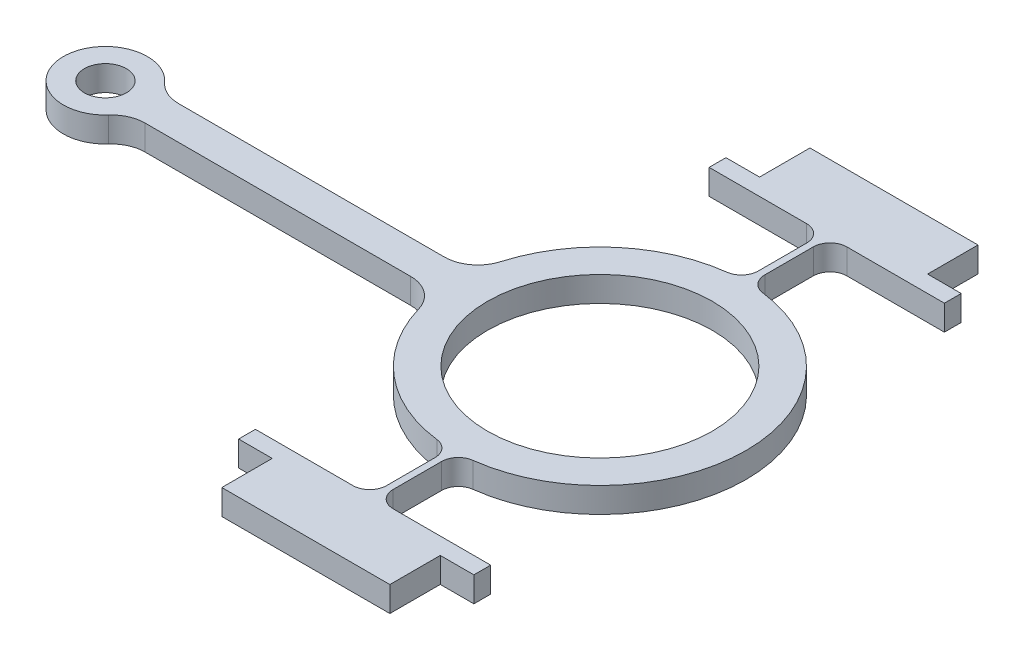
ISO-10303-21;
HEADER;
FILE_DESCRIPTION(('STEP AP214'),'2;1');
FILE_NAME('part.step','',(''),(''),'','','');
FILE_SCHEMA(('AUTOMOTIVE_DESIGN { 1 0 10303 214 1 1 1 1 }'));
ENDSEC;
DATA;
#1=APPLICATION_CONTEXT('core data for automotive mechanical design processes');
#2=APPLICATION_PROTOCOL_DEFINITION('international standard','automotive_design',2000,#1);
#3=PRODUCT_CONTEXT('',#1,'mechanical');
#4=PRODUCT('Part','Part','',(#3));
#5=PRODUCT_RELATED_PRODUCT_CATEGORY('part','',(#4));
#6=PRODUCT_DEFINITION_FORMATION('','',#4);
#7=PRODUCT_DEFINITION_CONTEXT('part definition',#1,'design');
#8=PRODUCT_DEFINITION('design','',#6,#7);
#9=PRODUCT_DEFINITION_SHAPE('','',#8);
#10=(LENGTH_UNIT() NAMED_UNIT(*) SI_UNIT(.MILLI.,.METRE.));
#11=(NAMED_UNIT(*) PLANE_ANGLE_UNIT() SI_UNIT($,.RADIAN.));
#12=(NAMED_UNIT(*) SI_UNIT($,.STERADIAN.) SOLID_ANGLE_UNIT());
#13=UNCERTAINTY_MEASURE_WITH_UNIT(LENGTH_MEASURE(1.E-05),#10,'distance_accuracy_value','');
#14=(GEOMETRIC_REPRESENTATION_CONTEXT(3) GLOBAL_UNCERTAINTY_ASSIGNED_CONTEXT((#13)) GLOBAL_UNIT_ASSIGNED_CONTEXT((#10,
#11,#12)) REPRESENTATION_CONTEXT('',''));
#15=CARTESIAN_POINT('',(0.,0.,0.));
#16=DIRECTION('',(0.,0.,1.));
#17=DIRECTION('',(1.,0.,0.));
#18=AXIS2_PLACEMENT_3D('',#15,#16,#17);
#19=CARTESIAN_POINT('',(-6.35,0.95,17.145));
#20=DIRECTION('',(1.,0.,0.));
#21=DIRECTION('',(0.,0.,-1.));
#22=AXIS2_PLACEMENT_3D('',#19,#20,#21);
#23=PLANE('',#22);
#24=DIRECTION('',(0.,1.,0.));
#25=VECTOR('',#24,1.);
#26=CARTESIAN_POINT('',(-6.35,0.95,18.415));
#27=LINE('',#26,#25);
#28=CARTESIAN_POINT('',(-6.35,-0.95,18.415));
#29=VERTEX_POINT('',#28);
#30=CARTESIAN_POINT('',(-6.35,0.95,18.415));
#31=VERTEX_POINT('',#30);
#32=EDGE_CURVE('E336',#29,#31,#27,.T.);
#33=ORIENTED_EDGE('',*,*,#32,.F.);
#34=DIRECTION('',(0.,0.,1.));
#35=VECTOR('',#34,1.);
#36=CARTESIAN_POINT('',(-6.35,-0.95,17.145));
#37=LINE('',#36,#35);
#38=CARTESIAN_POINT('',(-6.35,-0.95,22.225));
#39=VERTEX_POINT('',#38);
#40=EDGE_CURVE('E440',#29,#39,#37,.T.);
#41=ORIENTED_EDGE('',*,*,#40,.T.);
#42=DIRECTION('',(0.,-1.,0.));
#43=VECTOR('',#42,1.);
#44=CARTESIAN_POINT('',(-6.35,0.95,22.225));
#45=LINE('',#44,#43);
#46=CARTESIAN_POINT('',(-6.35,0.95,22.225));
#47=VERTEX_POINT('',#46);
#48=EDGE_CURVE('E488',#47,#39,#45,.T.);
#49=ORIENTED_EDGE('',*,*,#48,.F.);
#50=DIRECTION('',(0.,0.,1.));
#51=VECTOR('',#50,1.);
#52=CARTESIAN_POINT('',(-6.35,0.95,17.145));
#53=LINE('',#52,#51);
#54=EDGE_CURVE('E397',#31,#47,#53,.T.);
#55=ORIENTED_EDGE('',*,*,#54,.F.);
#56=EDGE_LOOP('',(#33,#41,#49,#55));
#57=FACE_BOUND('',#56,.T.);
#58=ADVANCED_FACE('F33',(#57),#23,.F.);
#59=CARTESIAN_POINT('',(6.34999999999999,0.95,22.225));
#60=DIRECTION('',(-1.,0.,0.));
#61=DIRECTION('',(0.,0.,1.));
#62=AXIS2_PLACEMENT_3D('',#59,#60,#61);
#63=PLANE('',#62);
#64=DIRECTION('',(0.,-1.,0.));
#65=VECTOR('',#64,1.);
#66=CARTESIAN_POINT('',(6.34999999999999,0.95,18.415));
#67=LINE('',#66,#65);
#68=CARTESIAN_POINT('',(6.34999999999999,0.95,18.415));
#69=VERTEX_POINT('',#68);
#70=CARTESIAN_POINT('',(6.34999999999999,-0.95,18.415));
#71=VERTEX_POINT('',#70);
#72=EDGE_CURVE('E566',#69,#71,#67,.T.);
#73=ORIENTED_EDGE('',*,*,#72,.F.);
#74=DIRECTION('',(0.,0.,-1.));
#75=VECTOR('',#74,1.);
#76=CARTESIAN_POINT('',(6.34999999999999,0.95,22.225));
#77=LINE('',#76,#75);
#78=CARTESIAN_POINT('',(6.34999999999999,0.95,22.225));
#79=VERTEX_POINT('',#78);
#80=EDGE_CURVE('E301',#79,#69,#77,.T.);
#81=ORIENTED_EDGE('',*,*,#80,.F.);
#82=DIRECTION('',(0.,-1.,0.));
#83=VECTOR('',#82,1.);
#84=CARTESIAN_POINT('',(6.34999999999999,0.95,22.225));
#85=LINE('',#84,#83);
#86=CARTESIAN_POINT('',(6.34999999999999,-0.95,22.225));
#87=VERTEX_POINT('',#86);
#88=EDGE_CURVE('E485',#79,#87,#85,.T.);
#89=ORIENTED_EDGE('',*,*,#88,.T.);
#90=DIRECTION('',(0.,0.,-1.));
#91=VECTOR('',#90,1.);
#92=CARTESIAN_POINT('',(6.34999999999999,-0.95,22.225));
#93=LINE('',#92,#91);
#94=EDGE_CURVE('E444',#87,#71,#93,.T.);
#95=ORIENTED_EDGE('',*,*,#94,.T.);
#96=EDGE_LOOP('',(#73,#81,#89,#95));
#97=FACE_BOUND('',#96,.T.);
#98=ADVANCED_FACE('F715',(#97),#63,.F.);
#99=CARTESIAN_POINT('',(0.,0.95,0.));
#100=DIRECTION('',(0.,1.,0.));
#101=DIRECTION('',(0.,0.,1.));
#102=AXIS2_PLACEMENT_3D('',#99,#100,#101);
#103=PLANE('',#102);
#104=DIRECTION('',(-1.,0.,0.));
#105=VECTOR('',#104,1.);
#106=CARTESIAN_POINT('',(6.34999999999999,0.95,17.145));
#107=LINE('',#106,#105);
#108=CARTESIAN_POINT('',(8.89000000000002,0.95,17.145));
#109=VERTEX_POINT('',#108);
#110=CARTESIAN_POINT('',(1.52,0.95,17.145));
#111=VERTEX_POINT('',#110);
#112=EDGE_CURVE('E290',#109,#111,#107,.T.);
#113=ORIENTED_EDGE('',*,*,#112,.T.);
#114=CARTESIAN_POINT('',(1.52,0.95,15.875));
#115=DIRECTION('',(0.,1.,0.));
#116=DIRECTION('',(0.,0.,1.));
#117=AXIS2_PLACEMENT_3D('',#114,#115,#116);
#118=CIRCLE('',#117,1.27);
#119=CARTESIAN_POINT('',(0.25,0.95,15.875));
#120=VERTEX_POINT('',#119);
#121=EDGE_CURVE('E537',#111,#120,#118,.F.);
#122=ORIENTED_EDGE('',*,*,#121,.T.);
#123=DIRECTION('',(0.,0.,-1.));
#124=VECTOR('',#123,1.);
#125=CARTESIAN_POINT('',(0.25,0.95,17.145));
#126=LINE('',#125,#124);
#127=CARTESIAN_POINT('',(0.25,0.95,12.2157971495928));
#128=VERTEX_POINT('',#127);
#129=EDGE_CURVE('E300',#120,#128,#126,.T.);
#130=ORIENTED_EDGE('',*,*,#129,.T.);
#131=CARTESIAN_POINT('',(1.52,0.95,12.2157971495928));
#132=DIRECTION('',(0.,1.,0.));
#133=DIRECTION('',(0.,0.,1.));
#134=AXIS2_PLACEMENT_3D('',#131,#132,#133);
#135=CIRCLE('',#134,1.27);
#136=CARTESIAN_POINT('',(1.36318440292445,0.95,10.9555158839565));
#137=VERTEX_POINT('',#136);
#138=EDGE_CURVE('E541',#128,#137,#135,.F.);
#139=ORIENTED_EDGE('',*,*,#138,.T.);
#140=CARTESIAN_POINT('',(0.,0.95,0.));
#141=DIRECTION('',(0.,1.,0.));
#142=DIRECTION('',(0.,0.,1.));
#143=AXIS2_PLACEMENT_3D('',#140,#141,#142);
#144=CIRCLE('',#143,11.04);
#145=CARTESIAN_POINT('',(1.36318440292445,0.95,-10.9555158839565));
#146=VERTEX_POINT('',#145);
#147=EDGE_CURVE('E404',#137,#146,#144,.T.);
#148=ORIENTED_EDGE('',*,*,#147,.T.);
#149=CARTESIAN_POINT('',(1.52,0.95,-12.2157971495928));
#150=DIRECTION('',(0.,1.,0.));
#151=DIRECTION('',(0.,0.,1.));
#152=AXIS2_PLACEMENT_3D('',#149,#150,#151);
#153=CIRCLE('',#152,1.27);
#154=CARTESIAN_POINT('',(0.25,0.95,-12.2157971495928));
#155=VERTEX_POINT('',#154);
#156=EDGE_CURVE('E558',#146,#155,#153,.F.);
#157=ORIENTED_EDGE('',*,*,#156,.T.);
#158=DIRECTION('',(0.,0.,-1.));
#159=VECTOR('',#158,1.);
#160=CARTESIAN_POINT('',(0.25,0.95,-11.0371690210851));
#161=LINE('',#160,#159);
#162=CARTESIAN_POINT('',(0.25,0.95,-15.875));
#163=VERTEX_POINT('',#162);
#164=EDGE_CURVE('E407',#155,#163,#161,.T.);
#165=ORIENTED_EDGE('',*,*,#164,.T.);
#166=CARTESIAN_POINT('',(1.52,0.95,-15.875));
#167=DIRECTION('',(0.,1.,0.));
#168=DIRECTION('',(0.,0.,1.));
#169=AXIS2_PLACEMENT_3D('',#166,#167,#168);
#170=CIRCLE('',#169,1.27);
#171=CARTESIAN_POINT('',(1.52,0.95,-17.145));
#172=VERTEX_POINT('',#171);
#173=EDGE_CURVE('E562',#163,#172,#170,.F.);
#174=ORIENTED_EDGE('',*,*,#173,.T.);
#175=DIRECTION('',(1.,0.,0.));
#176=VECTOR('',#175,1.);
#177=CARTESIAN_POINT('',(0.25,0.95,-17.145));
#178=LINE('',#177,#176);
#179=CARTESIAN_POINT('',(8.89000000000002,0.95,-17.145));
#180=VERTEX_POINT('',#179);
#181=EDGE_CURVE('E410',#172,#180,#178,.T.);
#182=ORIENTED_EDGE('',*,*,#181,.T.);
#183=DIRECTION('',(0.,0.,-1.));
#184=VECTOR('',#183,1.);
#185=CARTESIAN_POINT('',(8.89000000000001,0.95,-18.415));
#186=LINE('',#185,#184);
#187=CARTESIAN_POINT('',(8.89000000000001,0.95,-18.415));
#188=VERTEX_POINT('',#187);
#189=EDGE_CURVE('E339',#180,#188,#186,.T.);
#190=ORIENTED_EDGE('',*,*,#189,.T.);
#191=DIRECTION('',(-1.,0.,0.));
#192=VECTOR('',#191,1.);
#193=CARTESIAN_POINT('',(-8.89000000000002,0.95,-18.415));
#194=LINE('',#193,#192);
#195=CARTESIAN_POINT('',(6.35000000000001,0.95,-18.415));
#196=VERTEX_POINT('',#195);
#197=EDGE_CURVE('E350',#188,#196,#194,.T.);
#198=ORIENTED_EDGE('',*,*,#197,.T.);
#199=DIRECTION('',(0.,0.,-1.));
#200=VECTOR('',#199,1.);
#201=CARTESIAN_POINT('',(6.35000000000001,0.95,-17.145));
#202=LINE('',#201,#200);
#203=CARTESIAN_POINT('',(6.35000000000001,0.95,-22.225));
#204=VERTEX_POINT('',#203);
#205=EDGE_CURVE('E412',#196,#204,#202,.T.);
#206=ORIENTED_EDGE('',*,*,#205,.T.);
#207=DIRECTION('',(-1.,0.,0.));
#208=VECTOR('',#207,1.);
#209=CARTESIAN_POINT('',(6.35000000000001,0.95,-22.225));
#210=LINE('',#209,#208);
#211=CARTESIAN_POINT('',(-6.34999999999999,0.95,-22.225));
#212=VERTEX_POINT('',#211);
#213=EDGE_CURVE('E414',#204,#212,#210,.T.);
#214=ORIENTED_EDGE('',*,*,#213,.T.);
#215=DIRECTION('',(0.,0.,1.));
#216=VECTOR('',#215,1.);
#217=CARTESIAN_POINT('',(-6.34999999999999,0.95,-22.225));
#218=LINE('',#217,#216);
#219=CARTESIAN_POINT('',(-6.34999999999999,0.95,-18.415));
#220=VERTEX_POINT('',#219);
#221=EDGE_CURVE('E416',#212,#220,#218,.T.);
#222=ORIENTED_EDGE('',*,*,#221,.T.);
#223=CARTESIAN_POINT('',(-8.89000000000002,0.95,-18.415));
#224=VERTEX_POINT('',#223);
#225=EDGE_CURVE('E349',#220,#224,#194,.T.);
#226=ORIENTED_EDGE('',*,*,#225,.T.);
#227=DIRECTION('',(0.,0.,1.));
#228=VECTOR('',#227,1.);
#229=CARTESIAN_POINT('',(-8.89000000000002,0.95,-18.415));
#230=LINE('',#229,#228);
#231=CARTESIAN_POINT('',(-8.89000000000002,0.95,-17.145));
#232=VERTEX_POINT('',#231);
#233=EDGE_CURVE('E353',#224,#232,#230,.T.);
#234=ORIENTED_EDGE('',*,*,#233,.T.);
#235=DIRECTION('',(1.,0.,0.));
#236=VECTOR('',#235,1.);
#237=CARTESIAN_POINT('',(-6.34999999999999,0.95,-17.145));
#238=LINE('',#237,#236);
#239=CARTESIAN_POINT('',(-1.52,0.95,-17.145));
#240=VERTEX_POINT('',#239);
#241=EDGE_CURVE('E419',#232,#240,#238,.T.);
#242=ORIENTED_EDGE('',*,*,#241,.T.);
#243=CARTESIAN_POINT('',(-1.52,0.95,-15.875));
#244=DIRECTION('',(0.,1.,0.));
#245=DIRECTION('',(0.,0.,1.));
#246=AXIS2_PLACEMENT_3D('',#243,#244,#245);
#247=CIRCLE('',#246,1.27);
#248=CARTESIAN_POINT('',(-0.25,0.95,-15.875));
#249=VERTEX_POINT('',#248);
#250=EDGE_CURVE('E550',#240,#249,#247,.F.);
#251=ORIENTED_EDGE('',*,*,#250,.T.);
#252=DIRECTION('',(0.,0.,1.));
#253=VECTOR('',#252,1.);
#254=CARTESIAN_POINT('',(-0.25,0.95,-17.145));
#255=LINE('',#254,#253);
#256=CARTESIAN_POINT('',(-0.25,0.95,-12.2157971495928));
#257=VERTEX_POINT('',#256);
#258=EDGE_CURVE('E422',#249,#257,#255,.T.);
#259=ORIENTED_EDGE('',*,*,#258,.T.);
#260=CARTESIAN_POINT('',(-1.52,0.95,-12.2157971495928));
#261=DIRECTION('',(0.,1.,0.));
#262=DIRECTION('',(0.,0.,1.));
#263=AXIS2_PLACEMENT_3D('',#260,#261,#262);
#264=CIRCLE('',#263,1.27);
#265=CARTESIAN_POINT('',(-1.36318440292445,0.95,-10.9555158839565));
#266=VERTEX_POINT('',#265);
#267=EDGE_CURVE('E554',#257,#266,#264,.F.);
#268=ORIENTED_EDGE('',*,*,#267,.T.);
#269=CARTESIAN_POINT('',(0.,0.95,0.));
#270=DIRECTION('',(0.,1.,0.));
#271=DIRECTION('',(0.,0.,1.));
#272=AXIS2_PLACEMENT_3D('',#269,#270,#271);
#273=CIRCLE('',#272,11.04);
#274=CARTESIAN_POINT('',(-10.5965959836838,0.95,-3.09737849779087));
#275=VERTEX_POINT('',#274);
#276=EDGE_CURVE('E425',#266,#275,#273,.T.);
#277=ORIENTED_EDGE('',*,*,#276,.T.);
#278=CARTESIAN_POINT('',(-13.0345809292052,0.95,-3.81));
#279=DIRECTION('',(0.,1.,0.));
#280=DIRECTION('',(0.,0.,1.));
#281=AXIS2_PLACEMENT_3D('',#278,#279,#280);
#282=CIRCLE('',#281,2.54);
#283=CARTESIAN_POINT('',(-13.0345809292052,0.95,-1.27));
#284=VERTEX_POINT('',#283);
#285=EDGE_CURVE('E11',#275,#284,#282,.F.);
#286=ORIENTED_EDGE('',*,*,#285,.T.);
#287=DIRECTION('',(-1.,0.,0.));
#288=VECTOR('',#287,1.);
#289=CARTESIAN_POINT('',(-10.9667087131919,0.95,-1.27));
#290=LINE('',#289,#288);
#291=CARTESIAN_POINT('',(-33.1131222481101,0.95,-1.27));
#292=VERTEX_POINT('',#291);
#293=EDGE_CURVE('E427',#284,#292,#290,.T.);
#294=ORIENTED_EDGE('',*,*,#293,.T.);
#295=CARTESIAN_POINT('',(-33.1131222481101,0.95,-3.81));
#296=DIRECTION('',(0.,1.,0.));
#297=DIRECTION('',(0.,0.,1.));
#298=AXIS2_PLACEMENT_3D('',#295,#296,#297);
#299=CIRCLE('',#298,2.54);
#300=CARTESIAN_POINT('',(-35.00632646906,0.95,-2.11666666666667));
#301=VERTEX_POINT('',#300);
#302=EDGE_CURVE('E588',#292,#301,#299,.F.);
#303=ORIENTED_EDGE('',*,*,#302,.T.);
#304=CARTESIAN_POINT('',(-37.3728317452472,0.95,0.));
#305=DIRECTION('',(0.,1.,0.));
#306=DIRECTION('',(0.,0.,1.));
#307=AXIS2_PLACEMENT_3D('',#304,#305,#306);
#308=CIRCLE('',#307,3.175);
#309=CARTESIAN_POINT('',(-35.00632646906,0.95,2.11666666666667));
#310=VERTEX_POINT('',#309);
#311=EDGE_CURVE('E376',#301,#310,#308,.T.);
#312=ORIENTED_EDGE('',*,*,#311,.T.);
#313=CARTESIAN_POINT('',(-33.1131222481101,0.95,3.81));
#314=DIRECTION('',(0.,1.,0.));
#315=DIRECTION('',(0.,0.,1.));
#316=AXIS2_PLACEMENT_3D('',#313,#314,#315);
#317=CIRCLE('',#316,2.54);
#318=CARTESIAN_POINT('',(-33.1131222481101,0.95,1.27));
#319=VERTEX_POINT('',#318);
#320=EDGE_CURVE('E594',#310,#319,#317,.F.);
#321=ORIENTED_EDGE('',*,*,#320,.T.);
#322=DIRECTION('',(1.,0.,0.));
#323=VECTOR('',#322,1.);
#324=CARTESIAN_POINT('',(-37.3728317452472,0.95,1.27));
#325=LINE('',#324,#323);
#326=CARTESIAN_POINT('',(-13.0345809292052,0.95,1.27));
#327=VERTEX_POINT('',#326);
#328=EDGE_CURVE('E430',#319,#327,#325,.T.);
#329=ORIENTED_EDGE('',*,*,#328,.T.);
#330=CARTESIAN_POINT('',(-13.0345809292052,0.95,3.81));
#331=DIRECTION('',(0.,1.,0.));
#332=DIRECTION('',(0.,0.,1.));
#333=AXIS2_PLACEMENT_3D('',#330,#331,#332);
#334=CIRCLE('',#333,2.54);
#335=CARTESIAN_POINT('',(-10.5965959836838,0.95,3.09737849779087));
#336=VERTEX_POINT('',#335);
#337=EDGE_CURVE('E598',#327,#336,#334,.F.);
#338=ORIENTED_EDGE('',*,*,#337,.T.);
#339=CARTESIAN_POINT('',(0.,0.95,0.));
#340=DIRECTION('',(0.,1.,0.));
#341=DIRECTION('',(0.,0.,1.));
#342=AXIS2_PLACEMENT_3D('',#339,#340,#341);
#343=CIRCLE('',#342,11.04);
#344=CARTESIAN_POINT('',(-1.36318440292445,0.95,10.9555158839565));
#345=VERTEX_POINT('',#344);
#346=EDGE_CURVE('E433',#336,#345,#343,.T.);
#347=ORIENTED_EDGE('',*,*,#346,.T.);
#348=CARTESIAN_POINT('',(-1.52,0.95,12.2157971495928));
#349=DIRECTION('',(0.,1.,0.));
#350=DIRECTION('',(0.,0.,1.));
#351=AXIS2_PLACEMENT_3D('',#348,#349,#350);
#352=CIRCLE('',#351,1.27);
#353=CARTESIAN_POINT('',(-0.25,0.95,12.2157971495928));
#354=VERTEX_POINT('',#353);
#355=EDGE_CURVE('E546',#345,#354,#352,.F.);
#356=ORIENTED_EDGE('',*,*,#355,.T.);
#357=DIRECTION('',(0.,0.,1.));
#358=VECTOR('',#357,1.);
#359=CARTESIAN_POINT('',(-0.25,0.95,11.0371690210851));
#360=LINE('',#359,#358);
#361=CARTESIAN_POINT('',(-0.25,0.95,15.875));
#362=VERTEX_POINT('',#361);
#363=EDGE_CURVE('E391',#354,#362,#360,.T.);
#364=ORIENTED_EDGE('',*,*,#363,.T.);
#365=CARTESIAN_POINT('',(-1.52,0.95,15.875));
#366=DIRECTION('',(0.,1.,0.));
#367=DIRECTION('',(0.,0.,1.));
#368=AXIS2_PLACEMENT_3D('',#365,#366,#367);
#369=CIRCLE('',#368,1.27);
#370=CARTESIAN_POINT('',(-1.52,0.95,17.145));
#371=VERTEX_POINT('',#370);
#372=EDGE_CURVE('E533',#362,#371,#369,.F.);
#373=ORIENTED_EDGE('',*,*,#372,.T.);
#374=DIRECTION('',(-1.,0.,0.));
#375=VECTOR('',#374,1.);
#376=CARTESIAN_POINT('',(-0.25,0.95,17.145));
#377=LINE('',#376,#375);
#378=CARTESIAN_POINT('',(-8.89000000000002,0.95,17.145));
#379=VERTEX_POINT('',#378);
#380=EDGE_CURVE('E394',#371,#379,#377,.T.);
#381=ORIENTED_EDGE('',*,*,#380,.T.);
#382=DIRECTION('',(0.,0.,-1.));
#383=VECTOR('',#382,1.);
#384=CARTESIAN_POINT('',(-8.89000000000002,0.95,18.415));
#385=LINE('',#384,#383);
#386=CARTESIAN_POINT('',(-8.89000000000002,0.95,18.415));
#387=VERTEX_POINT('',#386);
#388=EDGE_CURVE('E319',#387,#379,#385,.T.);
#389=ORIENTED_EDGE('',*,*,#388,.F.);
#390=DIRECTION('',(-1.,0.,0.));
#391=VECTOR('',#390,1.);
#392=CARTESIAN_POINT('',(-8.89000000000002,0.95,18.415));
#393=LINE('',#392,#391);
#394=EDGE_CURVE('E322',#31,#387,#393,.T.);
#395=ORIENTED_EDGE('',*,*,#394,.F.);
#396=ORIENTED_EDGE('',*,*,#54,.T.);
#397=DIRECTION('',(1.,0.,0.));
#398=VECTOR('',#397,1.);
#399=CARTESIAN_POINT('',(-6.35,0.95,22.225));
#400=LINE('',#399,#398);
#401=EDGE_CURVE('E399',#47,#79,#400,.T.);
#402=ORIENTED_EDGE('',*,*,#401,.T.);
#403=ORIENTED_EDGE('',*,*,#80,.T.);
#404=CARTESIAN_POINT('',(8.89000000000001,0.95,18.415));
#405=VERTEX_POINT('',#404);
#406=EDGE_CURVE('E312',#405,#69,#393,.T.);
#407=ORIENTED_EDGE('',*,*,#406,.F.);
#408=DIRECTION('',(0.,0.,1.));
#409=VECTOR('',#408,1.);
#410=CARTESIAN_POINT('',(8.89000000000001,0.95,18.415));
#411=LINE('',#410,#409);
#412=EDGE_CURVE('E308',#109,#405,#411,.T.);
#413=ORIENTED_EDGE('',*,*,#412,.F.);
#414=EDGE_LOOP('',(#113,#122,#130,#139,#148,#157,#165,#174,#182,#190,#198,#206,#214,#222,#226,
#234,#242,#251,#259,#268,#277,#286,#294,#303,#312,#321,#329,#338,#347,#356,#364,#373,#381,#389,
#395,#396,#402,#403,#407,#413));
#415=FACE_BOUND('',#414,.T.);
#416=CARTESIAN_POINT('',(-37.3728317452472,0.95,0.));
#417=DIRECTION('',(0.,1.,0.));
#418=DIRECTION('',(0.,0.,1.));
#419=AXIS2_PLACEMENT_3D('',#416,#417,#418);
#420=CIRCLE('',#419,1.5875);
#421=CARTESIAN_POINT('',(-37.3728317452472,0.95,1.5875));
#422=VERTEX_POINT('',#421);
#423=EDGE_CURVE('E372',#422,#422,#420,.T.);
#424=ORIENTED_EDGE('',*,*,#423,.F.);
#425=EDGE_LOOP('',(#424));
#426=FACE_BOUND('',#425,.T.);
#427=CARTESIAN_POINT('',(0.,0.95,0.));
#428=DIRECTION('',(0.,1.,0.));
#429=DIRECTION('',(0.,0.,1.));
#430=AXIS2_PLACEMENT_3D('',#427,#428,#429);
#431=CIRCLE('',#430,8.5);
#432=CARTESIAN_POINT('',(0.,0.95,-8.5));
#433=VERTEX_POINT('',#432);
#434=EDGE_CURVE('E385',#433,#433,#431,.T.);
#435=ORIENTED_EDGE('',*,*,#434,.F.);
#436=EDGE_LOOP('',(#435));
#437=FACE_BOUND('',#436,.T.);
#438=ADVANCED_FACE('F315',(#415,#426,#437),#103,.T.);
#439=CARTESIAN_POINT('',(0.,-0.95,0.));
#440=DIRECTION('',(0.,1.,0.));
#441=DIRECTION('',(0.,0.,1.));
#442=AXIS2_PLACEMENT_3D('',#439,#440,#441);
#443=PLANE('',#442);
#444=DIRECTION('',(-1.,0.,0.));
#445=VECTOR('',#444,1.);
#446=CARTESIAN_POINT('',(-0.25,-0.95,17.145));
#447=LINE('',#446,#445);
#448=CARTESIAN_POINT('',(-1.52,-0.95,17.145));
#449=VERTEX_POINT('',#448);
#450=CARTESIAN_POINT('',(-8.89000000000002,-0.95,17.145));
#451=VERTEX_POINT('',#450);
#452=EDGE_CURVE('E438',#449,#451,#447,.T.);
#453=ORIENTED_EDGE('',*,*,#452,.F.);
#454=CARTESIAN_POINT('',(-1.52,-0.95,15.875));
#455=DIRECTION('',(0.,1.,0.));
#456=DIRECTION('',(0.,0.,1.));
#457=AXIS2_PLACEMENT_3D('',#454,#455,#456);
#458=CIRCLE('',#457,1.27);
#459=CARTESIAN_POINT('',(-0.25,-0.95,15.875));
#460=VERTEX_POINT('',#459);
#461=EDGE_CURVE('E531',#449,#460,#458,.T.);
#462=ORIENTED_EDGE('',*,*,#461,.T.);
#463=DIRECTION('',(0.,0.,1.));
#464=VECTOR('',#463,1.);
#465=CARTESIAN_POINT('',(-0.25,-0.95,11.0371690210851));
#466=LINE('',#465,#464);
#467=CARTESIAN_POINT('',(-0.25,-0.95,12.2157971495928));
#468=VERTEX_POINT('',#467);
#469=EDGE_CURVE('E388',#468,#460,#466,.T.);
#470=ORIENTED_EDGE('',*,*,#469,.F.);
#471=CARTESIAN_POINT('',(-1.52,-0.95,12.2157971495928));
#472=DIRECTION('',(0.,1.,0.));
#473=DIRECTION('',(0.,0.,1.));
#474=AXIS2_PLACEMENT_3D('',#471,#472,#473);
#475=CIRCLE('',#474,1.27);
#476=CARTESIAN_POINT('',(-1.36318440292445,-0.95,10.9555158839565));
#477=VERTEX_POINT('',#476);
#478=EDGE_CURVE('E543',#468,#477,#475,.T.);
#479=ORIENTED_EDGE('',*,*,#478,.T.);
#480=CARTESIAN_POINT('',(0.,-0.95,0.));
#481=DIRECTION('',(0.,1.,0.));
#482=DIRECTION('',(0.,0.,1.));
#483=AXIS2_PLACEMENT_3D('',#480,#481,#482);
#484=CIRCLE('',#483,11.04);
#485=CARTESIAN_POINT('',(-10.5965959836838,-0.95,3.09737849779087));
#486=VERTEX_POINT('',#485);
#487=EDGE_CURVE('E395',#486,#477,#484,.T.);
#488=ORIENTED_EDGE('',*,*,#487,.F.);
#489=CARTESIAN_POINT('',(-13.0345809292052,-0.95,3.81));
#490=DIRECTION('',(0.,1.,0.));
#491=DIRECTION('',(0.,0.,1.));
#492=AXIS2_PLACEMENT_3D('',#489,#490,#491);
#493=CIRCLE('',#492,2.54);
#494=CARTESIAN_POINT('',(-13.0345809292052,-0.95,1.27));
#495=VERTEX_POINT('',#494);
#496=EDGE_CURVE('E596',#486,#495,#493,.T.);
#497=ORIENTED_EDGE('',*,*,#496,.T.);
#498=DIRECTION('',(1.,0.,0.));
#499=VECTOR('',#498,1.);
#500=CARTESIAN_POINT('',(-37.3728317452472,-0.95,1.27));
#501=LINE('',#500,#499);
#502=CARTESIAN_POINT('',(-33.1131222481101,-0.95,1.27));
#503=VERTEX_POINT('',#502);
#504=EDGE_CURVE('E476',#503,#495,#501,.T.);
#505=ORIENTED_EDGE('',*,*,#504,.F.);
#506=CARTESIAN_POINT('',(-33.1131222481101,-0.95,3.81));
#507=DIRECTION('',(0.,1.,0.));
#508=DIRECTION('',(0.,0.,1.));
#509=AXIS2_PLACEMENT_3D('',#506,#507,#508);
#510=CIRCLE('',#509,2.54);
#511=CARTESIAN_POINT('',(-35.00632646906,-0.95,2.11666666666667));
#512=VERTEX_POINT('',#511);
#513=EDGE_CURVE('E592',#503,#512,#510,.T.);
#514=ORIENTED_EDGE('',*,*,#513,.T.);
#515=CARTESIAN_POINT('',(-37.3728317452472,-0.95,0.));
#516=DIRECTION('',(0.,1.,0.));
#517=DIRECTION('',(0.,0.,1.));
#518=AXIS2_PLACEMENT_3D('',#515,#516,#517);
#519=CIRCLE('',#518,3.175);
#520=CARTESIAN_POINT('',(-35.00632646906,-0.95,-2.11666666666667));
#521=VERTEX_POINT('',#520);
#522=EDGE_CURVE('E381',#512,#521,#519,.F.);
#523=ORIENTED_EDGE('',*,*,#522,.T.);
#524=CARTESIAN_POINT('',(-33.1131222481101,-0.95,-3.81));
#525=DIRECTION('',(0.,1.,0.));
#526=DIRECTION('',(0.,0.,1.));
#527=AXIS2_PLACEMENT_3D('',#524,#525,#526);
#528=CIRCLE('',#527,2.54);
#529=CARTESIAN_POINT('',(-33.1131222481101,-0.95,-1.27));
#530=VERTEX_POINT('',#529);
#531=EDGE_CURVE('E590',#521,#530,#528,.T.);
#532=ORIENTED_EDGE('',*,*,#531,.T.);
#533=DIRECTION('',(-1.,0.,0.));
#534=VECTOR('',#533,1.);
#535=CARTESIAN_POINT('',(-10.9667087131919,-0.95,-1.27));
#536=LINE('',#535,#534);
#537=CARTESIAN_POINT('',(-13.0345809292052,-0.95,-1.27));
#538=VERTEX_POINT('',#537);
#539=EDGE_CURVE('E473',#538,#530,#536,.T.);
#540=ORIENTED_EDGE('',*,*,#539,.F.);
#541=CARTESIAN_POINT('',(-13.0345809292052,-0.95,-3.81));
#542=DIRECTION('',(0.,1.,0.));
#543=DIRECTION('',(0.,0.,1.));
#544=AXIS2_PLACEMENT_3D('',#541,#542,#543);
#545=CIRCLE('',#544,2.54);
#546=CARTESIAN_POINT('',(-10.5965959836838,-0.95,-3.09737849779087));
#547=VERTEX_POINT('',#546);
#548=EDGE_CURVE('E41',#538,#547,#545,.T.);
#549=ORIENTED_EDGE('',*,*,#548,.T.);
#550=CARTESIAN_POINT('',(0.,-0.95,0.));
#551=DIRECTION('',(0.,1.,0.));
#552=DIRECTION('',(0.,0.,1.));
#553=AXIS2_PLACEMENT_3D('',#550,#551,#552);
#554=CIRCLE('',#553,11.04);
#555=CARTESIAN_POINT('',(-1.36318440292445,-0.95,-10.9555158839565));
#556=VERTEX_POINT('',#555);
#557=EDGE_CURVE('E471',#556,#547,#554,.T.);
#558=ORIENTED_EDGE('',*,*,#557,.F.);
#559=CARTESIAN_POINT('',(-1.52,-0.95,-12.2157971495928));
#560=DIRECTION('',(0.,1.,0.));
#561=DIRECTION('',(0.,0.,1.));
#562=AXIS2_PLACEMENT_3D('',#559,#560,#561);
#563=CIRCLE('',#562,1.27);
#564=CARTESIAN_POINT('',(-0.25,-0.95,-12.2157971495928));
#565=VERTEX_POINT('',#564);
#566=EDGE_CURVE('E552',#556,#565,#563,.T.);
#567=ORIENTED_EDGE('',*,*,#566,.T.);
#568=DIRECTION('',(0.,0.,1.));
#569=VECTOR('',#568,1.);
#570=CARTESIAN_POINT('',(-0.25,-0.95,-17.145));
#571=LINE('',#570,#569);
#572=CARTESIAN_POINT('',(-0.25,-0.95,-15.875));
#573=VERTEX_POINT('',#572);
#574=EDGE_CURVE('E468',#573,#565,#571,.T.);
#575=ORIENTED_EDGE('',*,*,#574,.F.);
#576=CARTESIAN_POINT('',(-1.52,-0.95,-15.875));
#577=DIRECTION('',(0.,1.,0.));
#578=DIRECTION('',(0.,0.,1.));
#579=AXIS2_PLACEMENT_3D('',#576,#577,#578);
#580=CIRCLE('',#579,1.27);
#581=CARTESIAN_POINT('',(-1.52,-0.95,-17.145));
#582=VERTEX_POINT('',#581);
#583=EDGE_CURVE('E548',#573,#582,#580,.T.);
#584=ORIENTED_EDGE('',*,*,#583,.T.);
#585=DIRECTION('',(1.,0.,0.));
#586=VECTOR('',#585,1.);
#587=CARTESIAN_POINT('',(-6.34999999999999,-0.95,-17.145));
#588=LINE('',#587,#586);
#589=CARTESIAN_POINT('',(-8.89000000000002,-0.95,-17.145));
#590=VERTEX_POINT('',#589);
#591=EDGE_CURVE('E465',#590,#582,#588,.T.);
#592=ORIENTED_EDGE('',*,*,#591,.F.);
#593=DIRECTION('',(0.,0.,-1.));
#594=VECTOR('',#593,1.);
#595=CARTESIAN_POINT('',(-8.89000000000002,-0.95,-18.415));
#596=LINE('',#595,#594);
#597=CARTESIAN_POINT('',(-8.89000000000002,-0.95,-18.415));
#598=VERTEX_POINT('',#597);
#599=EDGE_CURVE('E340',#590,#598,#596,.T.);
#600=ORIENTED_EDGE('',*,*,#599,.T.);
#601=DIRECTION('',(1.,0.,0.));
#602=VECTOR('',#601,1.);
#603=CARTESIAN_POINT('',(-8.89000000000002,-0.95,-18.415));
#604=LINE('',#603,#602);
#605=CARTESIAN_POINT('',(-6.34999999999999,-0.95,-18.415));
#606=VERTEX_POINT('',#605);
#607=EDGE_CURVE('E366',#598,#606,#604,.T.);
#608=ORIENTED_EDGE('',*,*,#607,.T.);
#609=DIRECTION('',(0.,0.,1.));
#610=VECTOR('',#609,1.);
#611=CARTESIAN_POINT('',(-6.34999999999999,-0.95,-22.225));
#612=LINE('',#611,#610);
#613=CARTESIAN_POINT('',(-6.34999999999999,-0.95,-22.225));
#614=VERTEX_POINT('',#613);
#615=EDGE_CURVE('E463',#614,#606,#612,.T.);
#616=ORIENTED_EDGE('',*,*,#615,.F.);
#617=DIRECTION('',(-1.,0.,0.));
#618=VECTOR('',#617,1.);
#619=CARTESIAN_POINT('',(6.35000000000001,-0.95,-22.225));
#620=LINE('',#619,#618);
#621=CARTESIAN_POINT('',(6.35000000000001,-0.95,-22.225));
#622=VERTEX_POINT('',#621);
#623=EDGE_CURVE('E461',#622,#614,#620,.T.);
#624=ORIENTED_EDGE('',*,*,#623,.F.);
#625=DIRECTION('',(0.,0.,-1.));
#626=VECTOR('',#625,1.);
#627=CARTESIAN_POINT('',(6.35000000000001,-0.95,-17.145));
#628=LINE('',#627,#626);
#629=CARTESIAN_POINT('',(6.35000000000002,-0.95,-18.415));
#630=VERTEX_POINT('',#629);
#631=EDGE_CURVE('E459',#630,#622,#628,.T.);
#632=ORIENTED_EDGE('',*,*,#631,.F.);
#633=CARTESIAN_POINT('',(8.89000000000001,-0.95,-18.415));
#634=VERTEX_POINT('',#633);
#635=EDGE_CURVE('E346',#630,#634,#604,.T.);
#636=ORIENTED_EDGE('',*,*,#635,.T.);
#637=DIRECTION('',(0.,0.,1.));
#638=VECTOR('',#637,1.);
#639=CARTESIAN_POINT('',(8.89000000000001,-0.95,-18.415));
#640=LINE('',#639,#638);
#641=CARTESIAN_POINT('',(8.89000000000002,-0.95,-17.145));
#642=VERTEX_POINT('',#641);
#643=EDGE_CURVE('E342',#634,#642,#640,.T.);
#644=ORIENTED_EDGE('',*,*,#643,.T.);
#645=DIRECTION('',(1.,0.,0.));
#646=VECTOR('',#645,1.);
#647=CARTESIAN_POINT('',(0.25,-0.95,-17.145));
#648=LINE('',#647,#646);
#649=CARTESIAN_POINT('',(1.52,-0.95,-17.145));
#650=VERTEX_POINT('',#649);
#651=EDGE_CURVE('E457',#650,#642,#648,.T.);
#652=ORIENTED_EDGE('',*,*,#651,.F.);
#653=CARTESIAN_POINT('',(1.52,-0.95,-15.875));
#654=DIRECTION('',(0.,1.,0.));
#655=DIRECTION('',(0.,0.,1.));
#656=AXIS2_PLACEMENT_3D('',#653,#654,#655);
#657=CIRCLE('',#656,1.27);
#658=CARTESIAN_POINT('',(0.25,-0.95,-15.875));
#659=VERTEX_POINT('',#658);
#660=EDGE_CURVE('E560',#650,#659,#657,.T.);
#661=ORIENTED_EDGE('',*,*,#660,.T.);
#662=DIRECTION('',(0.,0.,-1.));
#663=VECTOR('',#662,1.);
#664=CARTESIAN_POINT('',(0.25,-0.95,-11.0371690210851));
#665=LINE('',#664,#663);
#666=CARTESIAN_POINT('',(0.25,-0.95,-12.2157971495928));
#667=VERTEX_POINT('',#666);
#668=EDGE_CURVE('E454',#667,#659,#665,.T.);
#669=ORIENTED_EDGE('',*,*,#668,.F.);
#670=CARTESIAN_POINT('',(1.52,-0.95,-12.2157971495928));
#671=DIRECTION('',(0.,1.,0.));
#672=DIRECTION('',(0.,0.,1.));
#673=AXIS2_PLACEMENT_3D('',#670,#671,#672);
#674=CIRCLE('',#673,1.27);
#675=CARTESIAN_POINT('',(1.36318440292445,-0.95,-10.9555158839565));
#676=VERTEX_POINT('',#675);
#677=EDGE_CURVE('E556',#667,#676,#674,.T.);
#678=ORIENTED_EDGE('',*,*,#677,.T.);
#679=CARTESIAN_POINT('',(0.,-0.95,0.));
#680=DIRECTION('',(0.,1.,0.));
#681=DIRECTION('',(0.,0.,1.));
#682=AXIS2_PLACEMENT_3D('',#679,#680,#681);
#683=CIRCLE('',#682,11.04);
#684=CARTESIAN_POINT('',(1.36318440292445,-0.95,10.9555158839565));
#685=VERTEX_POINT('',#684);
#686=EDGE_CURVE('E451',#685,#676,#683,.T.);
#687=ORIENTED_EDGE('',*,*,#686,.F.);
#688=CARTESIAN_POINT('',(1.52,-0.95,12.2157971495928));
#689=DIRECTION('',(0.,1.,0.));
#690=DIRECTION('',(0.,0.,1.));
#691=AXIS2_PLACEMENT_3D('',#688,#689,#690);
#692=CIRCLE('',#691,1.27);
#693=CARTESIAN_POINT('',(0.25,-0.95,12.2157971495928));
#694=VERTEX_POINT('',#693);
#695=EDGE_CURVE('E539',#685,#694,#692,.T.);
#696=ORIENTED_EDGE('',*,*,#695,.T.);
#697=DIRECTION('',(0.,0.,-1.));
#698=VECTOR('',#697,1.);
#699=CARTESIAN_POINT('',(0.25,-0.95,17.145));
#700=LINE('',#699,#698);
#701=CARTESIAN_POINT('',(0.25,-0.95,15.875));
#702=VERTEX_POINT('',#701);
#703=EDGE_CURVE('E448',#702,#694,#700,.T.);
#704=ORIENTED_EDGE('',*,*,#703,.F.);
#705=CARTESIAN_POINT('',(1.52,-0.95,15.875));
#706=DIRECTION('',(0.,1.,0.));
#707=DIRECTION('',(0.,0.,1.));
#708=AXIS2_PLACEMENT_3D('',#705,#706,#707);
#709=CIRCLE('',#708,1.27);
#710=CARTESIAN_POINT('',(1.52,-0.95,17.145));
#711=VERTEX_POINT('',#710);
#712=EDGE_CURVE('E535',#702,#711,#709,.T.);
#713=ORIENTED_EDGE('',*,*,#712,.T.);
#714=DIRECTION('',(-1.,0.,0.));
#715=VECTOR('',#714,1.);
#716=CARTESIAN_POINT('',(6.34999999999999,-0.95,17.145));
#717=LINE('',#716,#715);
#718=CARTESIAN_POINT('',(8.89000000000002,-0.95,17.145));
#719=VERTEX_POINT('',#718);
#720=EDGE_CURVE('E446',#719,#711,#717,.T.);
#721=ORIENTED_EDGE('',*,*,#720,.F.);
#722=DIRECTION('',(0.,0.,-1.));
#723=VECTOR('',#722,1.);
#724=CARTESIAN_POINT('',(8.89000000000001,-0.95,18.415));
#725=LINE('',#724,#723);
#726=CARTESIAN_POINT('',(8.89000000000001,-0.95,18.415));
#727=VERTEX_POINT('',#726);
#728=EDGE_CURVE('E310',#727,#719,#725,.T.);
#729=ORIENTED_EDGE('',*,*,#728,.F.);
#730=DIRECTION('',(1.,0.,0.));
#731=VECTOR('',#730,1.);
#732=CARTESIAN_POINT('',(-8.89000000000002,-0.95,18.415));
#733=LINE('',#732,#731);
#734=EDGE_CURVE('E1129',#71,#727,#733,.T.);
#735=ORIENTED_EDGE('',*,*,#734,.F.);
#736=ORIENTED_EDGE('',*,*,#94,.F.);
#737=DIRECTION('',(1.,0.,0.));
#738=VECTOR('',#737,1.);
#739=CARTESIAN_POINT('',(-6.35,-0.95,22.225));
#740=LINE('',#739,#738);
#741=EDGE_CURVE('E442',#39,#87,#740,.T.);
#742=ORIENTED_EDGE('',*,*,#741,.F.);
#743=ORIENTED_EDGE('',*,*,#40,.F.);
#744=CARTESIAN_POINT('',(-8.89000000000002,-0.95,18.415));
#745=VERTEX_POINT('',#744);
#746=EDGE_CURVE('E1130',#745,#29,#733,.T.);
#747=ORIENTED_EDGE('',*,*,#746,.F.);
#748=DIRECTION('',(0.,0.,1.));
#749=VECTOR('',#748,1.);
#750=CARTESIAN_POINT('',(-8.89000000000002,-0.95,18.415));
#751=LINE('',#750,#749);
#752=EDGE_CURVE('E330',#451,#745,#751,.T.);
#753=ORIENTED_EDGE('',*,*,#752,.F.);
#754=EDGE_LOOP('',(#453,#462,#470,#479,#488,#497,#505,#514,#523,#532,#540,#549,#558,#567,#575,
#584,#592,#600,#608,#616,#624,#632,#636,#644,#652,#661,#669,#678,#687,#696,#704,#713,#721,#729,
#735,#736,#742,#743,#747,#753));
#755=FACE_BOUND('',#754,.T.);
#756=CARTESIAN_POINT('',(-37.3728317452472,-0.95,0.));
#757=DIRECTION('',(0.,1.,0.));
#758=DIRECTION('',(0.,0.,1.));
#759=AXIS2_PLACEMENT_3D('',#756,#757,#758);
#760=CIRCLE('',#759,1.5875);
#761=CARTESIAN_POINT('',(-37.3728317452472,-0.95,1.5875));
#762=VERTEX_POINT('',#761);
#763=EDGE_CURVE('E373',#762,#762,#760,.T.);
#764=ORIENTED_EDGE('',*,*,#763,.T.);
#765=EDGE_LOOP('',(#764));
#766=FACE_BOUND('',#765,.T.);
#767=CARTESIAN_POINT('',(0.,-0.95,0.));
#768=DIRECTION('',(0.,1.,0.));
#769=DIRECTION('',(0.,0.,1.));
#770=AXIS2_PLACEMENT_3D('',#767,#768,#769);
#771=CIRCLE('',#770,8.5);
#772=CARTESIAN_POINT('',(0.,-0.95,-8.5));
#773=VERTEX_POINT('',#772);
#774=EDGE_CURVE('E384',#773,#773,#771,.T.);
#775=ORIENTED_EDGE('',*,*,#774,.T.);
#776=EDGE_LOOP('',(#775));
#777=FACE_BOUND('',#776,.T.);
#778=ADVANCED_FACE('F613',(#755,#766,#777),#443,.F.);
#779=CARTESIAN_POINT('',(-0.25,0.95,11.0371690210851));
#780=DIRECTION('',(1.,0.,0.));
#781=DIRECTION('',(0.,0.,-1.));
#782=AXIS2_PLACEMENT_3D('',#779,#780,#781);
#783=PLANE('',#782);
#784=ORIENTED_EDGE('',*,*,#469,.T.);
#785=DIRECTION('',(0.,-1.,0.));
#786=VECTOR('',#785,1.);
#787=CARTESIAN_POINT('',(-0.25,0.95,15.875));
#788=LINE('',#787,#786);
#789=EDGE_CURVE('E497',#460,#362,#788,.F.);
#790=ORIENTED_EDGE('',*,*,#789,.T.);
#791=ORIENTED_EDGE('',*,*,#363,.F.);
#792=DIRECTION('',(0.,1.,0.));
#793=VECTOR('',#792,1.);
#794=CARTESIAN_POINT('',(-0.25,-0.95,12.2157971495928));
#795=LINE('',#794,#793);
#796=EDGE_CURVE('E494',#354,#468,#795,.F.);
#797=ORIENTED_EDGE('',*,*,#796,.T.);
#798=EDGE_LOOP('',(#784,#790,#791,#797));
#799=FACE_BOUND('',#798,.T.);
#800=ADVANCED_FACE('F730',(#799),#783,.F.);
#801=CARTESIAN_POINT('',(-0.25,0.95,17.145));
#802=DIRECTION('',(0.,0.,1.));
#803=DIRECTION('',(1.,0.,0.));
#804=AXIS2_PLACEMENT_3D('',#801,#802,#803);
#805=PLANE('',#804);
#806=ORIENTED_EDGE('',*,*,#380,.F.);
#807=DIRECTION('',(0.,-1.,0.));
#808=VECTOR('',#807,1.);
#809=CARTESIAN_POINT('',(-1.52,-0.95,17.145));
#810=LINE('',#809,#808);
#811=EDGE_CURVE('E491',#371,#449,#810,.T.);
#812=ORIENTED_EDGE('',*,*,#811,.T.);
#813=ORIENTED_EDGE('',*,*,#452,.T.);
#814=DIRECTION('',(0.,1.,0.));
#815=VECTOR('',#814,1.);
#816=CARTESIAN_POINT('',(-8.89000000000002,-18.7752994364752,17.145));
#817=LINE('',#816,#815);
#818=EDGE_CURVE('E311',#451,#379,#817,.T.);
#819=ORIENTED_EDGE('',*,*,#818,.T.);
#820=EDGE_LOOP('',(#806,#812,#813,#819));
#821=FACE_BOUND('',#820,.T.);
#822=ADVANCED_FACE('F727',(#821),#805,.F.);
#823=CARTESIAN_POINT('',(-6.35,0.95,22.225));
#824=DIRECTION('',(0.,0.,-1.));
#825=DIRECTION('',(-1.,0.,0.));
#826=AXIS2_PLACEMENT_3D('',#823,#824,#825);
#827=PLANE('',#826);
#828=ORIENTED_EDGE('',*,*,#741,.T.);
#829=ORIENTED_EDGE('',*,*,#88,.F.);
#830=ORIENTED_EDGE('',*,*,#401,.F.);
#831=ORIENTED_EDGE('',*,*,#48,.T.);
#832=EDGE_LOOP('',(#828,#829,#830,#831));
#833=FACE_BOUND('',#832,.T.);
#834=ADVANCED_FACE('F726',(#833),#827,.F.);
#835=CARTESIAN_POINT('',(6.34999999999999,0.95,17.145));
#836=DIRECTION('',(0.,0.,1.));
#837=DIRECTION('',(1.,0.,0.));
#838=AXIS2_PLACEMENT_3D('',#835,#836,#837);
#839=PLANE('',#838);
#840=ORIENTED_EDGE('',*,*,#720,.T.);
#841=DIRECTION('',(0.,-1.,0.));
#842=VECTOR('',#841,1.);
#843=CARTESIAN_POINT('',(1.52,0.95,17.145));
#844=LINE('',#843,#842);
#845=EDGE_CURVE('E296',#711,#111,#844,.F.);
#846=ORIENTED_EDGE('',*,*,#845,.T.);
#847=ORIENTED_EDGE('',*,*,#112,.F.);
#848=DIRECTION('',(0.,1.,0.));
#849=VECTOR('',#848,1.);
#850=CARTESIAN_POINT('',(8.89000000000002,-18.7752994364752,17.145));
#851=LINE('',#850,#849);
#852=EDGE_CURVE('E294',#719,#109,#851,.T.);
#853=ORIENTED_EDGE('',*,*,#852,.F.);
#854=EDGE_LOOP('',(#840,#846,#847,#853));
#855=FACE_BOUND('',#854,.T.);
#856=ADVANCED_FACE('F293',(#855),#839,.F.);
#857=CARTESIAN_POINT('',(0.25,0.95,17.145));
#858=DIRECTION('',(-1.,0.,0.));
#859=DIRECTION('',(0.,0.,1.));
#860=AXIS2_PLACEMENT_3D('',#857,#858,#859);
#861=PLANE('',#860);
#862=ORIENTED_EDGE('',*,*,#129,.F.);
#863=DIRECTION('',(0.,-1.,0.));
#864=VECTOR('',#863,1.);
#865=CARTESIAN_POINT('',(0.25,-0.95,15.875));
#866=LINE('',#865,#864);
#867=EDGE_CURVE('E501',#120,#702,#866,.T.);
#868=ORIENTED_EDGE('',*,*,#867,.T.);
#869=ORIENTED_EDGE('',*,*,#703,.T.);
#870=DIRECTION('',(0.,1.,0.));
#871=VECTOR('',#870,1.);
#872=CARTESIAN_POINT('',(0.25,0.95,12.2157971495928));
#873=LINE('',#872,#871);
#874=EDGE_CURVE('E499',#694,#128,#873,.T.);
#875=ORIENTED_EDGE('',*,*,#874,.T.);
#876=EDGE_LOOP('',(#862,#868,#869,#875));
#877=FACE_BOUND('',#876,.T.);
#878=ADVANCED_FACE('F880',(#877),#861,.F.);
#879=CARTESIAN_POINT('',(0.,0.95,0.));
#880=DIRECTION('',(0.,-1.,0.));
#881=DIRECTION('',(0.,0.,-1.));
#882=AXIS2_PLACEMENT_3D('',#879,#880,#881);
#883=CYLINDRICAL_SURFACE('',#882,11.04);
#884=ORIENTED_EDGE('',*,*,#147,.F.);
#885=DIRECTION('',(0.,-1.,0.));
#886=VECTOR('',#885,1.);
#887=CARTESIAN_POINT('',(1.36318440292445,0.95,10.9555158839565));
#888=LINE('',#887,#886);
#889=EDGE_CURVE('E507',#137,#685,#888,.T.);
#890=ORIENTED_EDGE('',*,*,#889,.T.);
#891=ORIENTED_EDGE('',*,*,#686,.T.);
#892=DIRECTION('',(0.,-1.,0.));
#893=VECTOR('',#892,1.);
#894=CARTESIAN_POINT('',(1.36318440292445,0.95,-10.9555158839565));
#895=LINE('',#894,#893);
#896=EDGE_CURVE('E505',#676,#146,#895,.F.);
#897=ORIENTED_EDGE('',*,*,#896,.T.);
#898=EDGE_LOOP('',(#884,#890,#891,#897));
#899=FACE_BOUND('',#898,.T.);
#900=ADVANCED_FACE('F1041',(#899),#883,.T.);
#901=CARTESIAN_POINT('',(0.25,0.95,-11.0371690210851));
#902=DIRECTION('',(-1.,0.,0.));
#903=DIRECTION('',(0.,0.,1.));
#904=AXIS2_PLACEMENT_3D('',#901,#902,#903);
#905=PLANE('',#904);
#906=ORIENTED_EDGE('',*,*,#164,.F.);
#907=DIRECTION('',(0.,1.,0.));
#908=VECTOR('',#907,1.);
#909=CARTESIAN_POINT('',(0.25,-0.95,-12.2157971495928));
#910=LINE('',#909,#908);
#911=EDGE_CURVE('E525',#155,#667,#910,.F.);
#912=ORIENTED_EDGE('',*,*,#911,.T.);
#913=ORIENTED_EDGE('',*,*,#668,.T.);
#914=DIRECTION('',(0.,-1.,0.));
#915=VECTOR('',#914,1.);
#916=CARTESIAN_POINT('',(0.25,0.95,-15.875));
#917=LINE('',#916,#915);
#918=EDGE_CURVE('E523',#659,#163,#917,.F.);
#919=ORIENTED_EDGE('',*,*,#918,.T.);
#920=EDGE_LOOP('',(#906,#912,#913,#919));
#921=FACE_BOUND('',#920,.T.);
#922=ADVANCED_FACE('F699',(#921),#905,.F.);
#923=CARTESIAN_POINT('',(0.25,0.95,-17.145));
#924=DIRECTION('',(0.,0.,-1.));
#925=DIRECTION('',(-1.,0.,0.));
#926=AXIS2_PLACEMENT_3D('',#923,#924,#925);
#927=PLANE('',#926);
#928=ORIENTED_EDGE('',*,*,#181,.F.);
#929=DIRECTION('',(0.,-1.,0.));
#930=VECTOR('',#929,1.);
#931=CARTESIAN_POINT('',(1.52,-0.95,-17.145));
#932=LINE('',#931,#930);
#933=EDGE_CURVE('E528',#172,#650,#932,.T.);
#934=ORIENTED_EDGE('',*,*,#933,.T.);
#935=ORIENTED_EDGE('',*,*,#651,.T.);
#936=DIRECTION('',(0.,1.,0.));
#937=VECTOR('',#936,1.);
#938=CARTESIAN_POINT('',(8.89000000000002,-18.7752994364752,-17.145));
#939=LINE('',#938,#937);
#940=EDGE_CURVE('E343',#642,#180,#939,.T.);
#941=ORIENTED_EDGE('',*,*,#940,.T.);
#942=EDGE_LOOP('',(#928,#934,#935,#941));
#943=FACE_BOUND('',#942,.T.);
#944=ADVANCED_FACE('F693',(#943),#927,.F.);
#945=CARTESIAN_POINT('',(6.35000000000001,0.95,-17.145));
#946=DIRECTION('',(-1.,0.,0.));
#947=DIRECTION('',(0.,0.,1.));
#948=AXIS2_PLACEMENT_3D('',#945,#946,#947);
#949=PLANE('',#948);
#950=ORIENTED_EDGE('',*,*,#205,.F.);
#951=DIRECTION('',(0.,-1.,0.));
#952=VECTOR('',#951,1.);
#953=CARTESIAN_POINT('',(6.35000000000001,0.95,-18.415));
#954=LINE('',#953,#952);
#955=EDGE_CURVE('E369',#196,#630,#954,.T.);
#956=ORIENTED_EDGE('',*,*,#955,.T.);
#957=ORIENTED_EDGE('',*,*,#631,.T.);
#958=DIRECTION('',(0.,-1.,0.));
#959=VECTOR('',#958,1.);
#960=CARTESIAN_POINT('',(6.35000000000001,0.95,-22.225));
#961=LINE('',#960,#959);
#962=EDGE_CURVE('E482',#204,#622,#961,.T.);
#963=ORIENTED_EDGE('',*,*,#962,.F.);
#964=EDGE_LOOP('',(#950,#956,#957,#963));
#965=FACE_BOUND('',#964,.T.);
#966=ADVANCED_FACE('F676',(#965),#949,.F.);
#967=CARTESIAN_POINT('',(6.35000000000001,0.95,-22.225));
#968=DIRECTION('',(0.,0.,1.));
#969=DIRECTION('',(1.,0.,0.));
#970=AXIS2_PLACEMENT_3D('',#967,#968,#969);
#971=PLANE('',#970);
#972=ORIENTED_EDGE('',*,*,#623,.T.);
#973=DIRECTION('',(0.,-1.,0.));
#974=VECTOR('',#973,1.);
#975=CARTESIAN_POINT('',(-6.34999999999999,0.95,-22.225));
#976=LINE('',#975,#974);
#977=EDGE_CURVE('E435',#212,#614,#976,.T.);
#978=ORIENTED_EDGE('',*,*,#977,.F.);
#979=ORIENTED_EDGE('',*,*,#213,.F.);
#980=ORIENTED_EDGE('',*,*,#962,.T.);
#981=EDGE_LOOP('',(#972,#978,#979,#980));
#982=FACE_BOUND('',#981,.T.);
#983=ADVANCED_FACE('F673',(#982),#971,.F.);
#984=CARTESIAN_POINT('',(-6.34999999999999,0.95,-22.225));
#985=DIRECTION('',(1.,0.,0.));
#986=DIRECTION('',(0.,0.,-1.));
#987=AXIS2_PLACEMENT_3D('',#984,#985,#986);
#988=PLANE('',#987);
#989=ORIENTED_EDGE('',*,*,#615,.T.);
#990=DIRECTION('',(0.,1.,0.));
#991=VECTOR('',#990,1.);
#992=CARTESIAN_POINT('',(-6.34999999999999,0.95,-18.415));
#993=LINE('',#992,#991);
#994=EDGE_CURVE('E564',#606,#220,#993,.T.);
#995=ORIENTED_EDGE('',*,*,#994,.T.);
#996=ORIENTED_EDGE('',*,*,#221,.F.);
#997=ORIENTED_EDGE('',*,*,#977,.T.);
#998=EDGE_LOOP('',(#989,#995,#996,#997));
#999=FACE_BOUND('',#998,.T.);
#1000=ADVANCED_FACE('F669',(#999),#988,.F.);
#1001=CARTESIAN_POINT('',(-6.34999999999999,0.95,-17.145));
#1002=DIRECTION('',(0.,0.,-1.));
#1003=DIRECTION('',(-1.,0.,0.));
#1004=AXIS2_PLACEMENT_3D('',#1001,#1002,#1003);
#1005=PLANE('',#1004);
#1006=ORIENTED_EDGE('',*,*,#591,.T.);
#1007=DIRECTION('',(0.,-1.,0.));
#1008=VECTOR('',#1007,1.);
#1009=CARTESIAN_POINT('',(-1.52,0.95,-17.145));
#1010=LINE('',#1009,#1008);
#1011=EDGE_CURVE('E518',#582,#240,#1010,.F.);
#1012=ORIENTED_EDGE('',*,*,#1011,.T.);
#1013=ORIENTED_EDGE('',*,*,#241,.F.);
#1014=DIRECTION('',(0.,1.,0.));
#1015=VECTOR('',#1014,1.);
#1016=CARTESIAN_POINT('',(-8.89000000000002,-18.7752994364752,-17.145));
#1017=LINE('',#1016,#1015);
#1018=EDGE_CURVE('E359',#590,#232,#1017,.T.);
#1019=ORIENTED_EDGE('',*,*,#1018,.F.);
#1020=EDGE_LOOP('',(#1006,#1012,#1013,#1019));
#1021=FACE_BOUND('',#1020,.T.);
#1022=ADVANCED_FACE('F655',(#1021),#1005,.F.);
#1023=CARTESIAN_POINT('',(-0.25,0.95,-17.145));
#1024=DIRECTION('',(1.,0.,0.));
#1025=DIRECTION('',(0.,0.,-1.));
#1026=AXIS2_PLACEMENT_3D('',#1023,#1024,#1025);
#1027=PLANE('',#1026);
#1028=ORIENTED_EDGE('',*,*,#258,.F.);
#1029=DIRECTION('',(0.,-1.,0.));
#1030=VECTOR('',#1029,1.);
#1031=CARTESIAN_POINT('',(-0.25,-0.95,-15.875));
#1032=LINE('',#1031,#1030);
#1033=EDGE_CURVE('E515',#249,#573,#1032,.T.);
#1034=ORIENTED_EDGE('',*,*,#1033,.T.);
#1035=ORIENTED_EDGE('',*,*,#574,.T.);
#1036=DIRECTION('',(0.,1.,0.));
#1037=VECTOR('',#1036,1.);
#1038=CARTESIAN_POINT('',(-0.25,0.95,-12.2157971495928));
#1039=LINE('',#1038,#1037);
#1040=EDGE_CURVE('E513',#565,#257,#1039,.T.);
#1041=ORIENTED_EDGE('',*,*,#1040,.T.);
#1042=EDGE_LOOP('',(#1028,#1034,#1035,#1041));
#1043=FACE_BOUND('',#1042,.T.);
#1044=ADVANCED_FACE('F646',(#1043),#1027,.F.);
#1045=CARTESIAN_POINT('',(0.,0.95,0.));
#1046=DIRECTION('',(0.,-1.,0.));
#1047=DIRECTION('',(0.,0.,-1.));
#1048=AXIS2_PLACEMENT_3D('',#1045,#1046,#1047);
#1049=CYLINDRICAL_SURFACE('',#1048,11.04);
#1050=ORIENTED_EDGE('',*,*,#557,.T.);
#1051=DIRECTION('',(0.,-1.,0.));
#1052=VECTOR('',#1051,1.);
#1053=CARTESIAN_POINT('',(-10.5965959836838,0.95,-3.09737849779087));
#1054=LINE('',#1053,#1052);
#1055=EDGE_CURVE('E54',#547,#275,#1054,.F.);
#1056=ORIENTED_EDGE('',*,*,#1055,.T.);
#1057=ORIENTED_EDGE('',*,*,#276,.F.);
#1058=DIRECTION('',(0.,-1.,0.));
#1059=VECTOR('',#1058,1.);
#1060=CARTESIAN_POINT('',(-1.36318440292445,0.95,-10.9555158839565));
#1061=LINE('',#1060,#1059);
#1062=EDGE_CURVE('E520',#266,#556,#1061,.T.);
#1063=ORIENTED_EDGE('',*,*,#1062,.T.);
#1064=EDGE_LOOP('',(#1050,#1056,#1057,#1063));
#1065=FACE_BOUND('',#1064,.T.);
#1066=ADVANCED_FACE('F639',(#1065),#1049,.T.);
#1067=CARTESIAN_POINT('',(-10.9667087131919,0.95,-1.27));
#1068=DIRECTION('',(0.,0.,1.));
#1069=DIRECTION('',(1.,0.,0.));
#1070=AXIS2_PLACEMENT_3D('',#1067,#1068,#1069);
#1071=PLANE('',#1070);
#1072=ORIENTED_EDGE('',*,*,#539,.T.);
#1073=DIRECTION('',(0.,1.,0.));
#1074=VECTOR('',#1073,1.);
#1075=CARTESIAN_POINT('',(-33.1131222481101,0.95,-1.27));
#1076=LINE('',#1075,#1074);
#1077=EDGE_CURVE('E572',#530,#292,#1076,.T.);
#1078=ORIENTED_EDGE('',*,*,#1077,.T.);
#1079=ORIENTED_EDGE('',*,*,#293,.F.);
#1080=DIRECTION('',(0.,1.,0.));
#1081=VECTOR('',#1080,1.);
#1082=CARTESIAN_POINT('',(-13.0345809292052,-0.95,-1.27));
#1083=LINE('',#1082,#1081);
#1084=EDGE_CURVE('E569',#284,#538,#1083,.F.);
#1085=ORIENTED_EDGE('',*,*,#1084,.T.);
#1086=EDGE_LOOP('',(#1072,#1078,#1079,#1085));
#1087=FACE_BOUND('',#1086,.T.);
#1088=ADVANCED_FACE('F632',(#1087),#1071,.F.);
#1089=CARTESIAN_POINT('',(-37.3728317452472,0.95,1.27));
#1090=DIRECTION('',(0.,0.,-1.));
#1091=DIRECTION('',(-1.,0.,0.));
#1092=AXIS2_PLACEMENT_3D('',#1089,#1090,#1091);
#1093=PLANE('',#1092);
#1094=ORIENTED_EDGE('',*,*,#328,.F.);
#1095=DIRECTION('',(0.,1.,0.));
#1096=VECTOR('',#1095,1.);
#1097=CARTESIAN_POINT('',(-33.1131222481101,0.95,1.27));
#1098=LINE('',#1097,#1096);
#1099=EDGE_CURVE('E581',#319,#503,#1098,.F.);
#1100=ORIENTED_EDGE('',*,*,#1099,.T.);
#1101=ORIENTED_EDGE('',*,*,#504,.T.);
#1102=DIRECTION('',(0.,1.,0.));
#1103=VECTOR('',#1102,1.);
#1104=CARTESIAN_POINT('',(-13.0345809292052,0.95,1.27));
#1105=LINE('',#1104,#1103);
#1106=EDGE_CURVE('E579',#495,#327,#1105,.T.);
#1107=ORIENTED_EDGE('',*,*,#1106,.T.);
#1108=EDGE_LOOP('',(#1094,#1100,#1101,#1107));
#1109=FACE_BOUND('',#1108,.T.);
#1110=ADVANCED_FACE('F616',(#1109),#1093,.F.);
#1111=CARTESIAN_POINT('',(0.,0.95,0.));
#1112=DIRECTION('',(0.,-1.,0.));
#1113=DIRECTION('',(0.,0.,-1.));
#1114=AXIS2_PLACEMENT_3D('',#1111,#1112,#1113);
#1115=CYLINDRICAL_SURFACE('',#1114,11.04);
#1116=ORIENTED_EDGE('',*,*,#346,.F.);
#1117=DIRECTION('',(0.,-1.,0.));
#1118=VECTOR('',#1117,1.);
#1119=CARTESIAN_POINT('',(-10.5965959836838,0.95,3.09737849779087));
#1120=LINE('',#1119,#1118);
#1121=EDGE_CURVE('E584',#336,#486,#1120,.T.);
#1122=ORIENTED_EDGE('',*,*,#1121,.T.);
#1123=ORIENTED_EDGE('',*,*,#487,.T.);
#1124=DIRECTION('',(0.,-1.,0.));
#1125=VECTOR('',#1124,1.);
#1126=CARTESIAN_POINT('',(-1.36318440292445,0.95,10.9555158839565));
#1127=LINE('',#1126,#1125);
#1128=EDGE_CURVE('E510',#477,#345,#1127,.F.);
#1129=ORIENTED_EDGE('',*,*,#1128,.T.);
#1130=EDGE_LOOP('',(#1116,#1122,#1123,#1129));
#1131=FACE_BOUND('',#1130,.T.);
#1132=ADVANCED_FACE('F606',(#1131),#1115,.T.);
#1133=CARTESIAN_POINT('',(0.,0.95,0.));
#1134=DIRECTION('',(0.,-1.,0.));
#1135=DIRECTION('',(0.,0.,-1.));
#1136=AXIS2_PLACEMENT_3D('',#1133,#1134,#1135);
#1137=CYLINDRICAL_SURFACE('',#1136,8.5);
#1138=CARTESIAN_POINT('',(0.,0.95,-8.5));
#1139=CARTESIAN_POINT('',(0.,0.930208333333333,-8.5));
#1140=CARTESIAN_POINT('',(0.,0.910416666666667,-8.5));
#1141=CARTESIAN_POINT('',(0.,0.870833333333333,-8.5));
#1142=CARTESIAN_POINT('',(0.,0.851041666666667,-8.5));
#1143=CARTESIAN_POINT('',(0.,0.811458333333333,-8.5));
#1144=CARTESIAN_POINT('',(0.,0.791666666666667,-8.5));
#1145=CARTESIAN_POINT('',(0.,0.752083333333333,-8.5));
#1146=CARTESIAN_POINT('',(0.,0.732291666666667,-8.5));
#1147=CARTESIAN_POINT('',(0.,0.692708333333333,-8.5));
#1148=CARTESIAN_POINT('',(0.,0.672916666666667,-8.5));
#1149=CARTESIAN_POINT('',(0.,0.633333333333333,-8.5));
#1150=CARTESIAN_POINT('',(0.,0.613541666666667,-8.5));
#1151=CARTESIAN_POINT('',(0.,0.573958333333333,-8.5));
#1152=CARTESIAN_POINT('',(0.,0.554166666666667,-8.5));
#1153=CARTESIAN_POINT('',(0.,0.514583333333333,-8.5));
#1154=CARTESIAN_POINT('',(0.,0.494791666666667,-8.5));
#1155=CARTESIAN_POINT('',(0.,0.455208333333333,-8.5));
#1156=CARTESIAN_POINT('',(0.,0.435416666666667,-8.5));
#1157=CARTESIAN_POINT('',(0.,0.395833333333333,-8.5));
#1158=CARTESIAN_POINT('',(0.,0.376041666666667,-8.5));
#1159=CARTESIAN_POINT('',(0.,0.336458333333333,-8.5));
#1160=CARTESIAN_POINT('',(0.,0.316666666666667,-8.5));
#1161=CARTESIAN_POINT('',(0.,0.277083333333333,-8.5));
#1162=CARTESIAN_POINT('',(0.,0.257291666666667,-8.5));
#1163=CARTESIAN_POINT('',(0.,0.217708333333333,-8.5));
#1164=CARTESIAN_POINT('',(0.,0.197916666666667,-8.5));
#1165=CARTESIAN_POINT('',(0.,0.158333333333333,-8.5));
#1166=CARTESIAN_POINT('',(0.,0.138541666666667,-8.5));
#1167=CARTESIAN_POINT('',(0.,0.0989583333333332,-8.5));
#1168=CARTESIAN_POINT('',(0.,0.0791666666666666,-8.5));
#1169=CARTESIAN_POINT('',(0.,0.0395833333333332,-8.5));
#1170=CARTESIAN_POINT('',(0.,0.0197916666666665,-8.5));
#1171=CARTESIAN_POINT('',(0.,-0.0197916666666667,-8.5));
#1172=CARTESIAN_POINT('',(0.,-0.0395833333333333,-8.5));
#1173=CARTESIAN_POINT('',(0.,-0.0791666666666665,-8.5));
#1174=CARTESIAN_POINT('',(0.,-0.0989583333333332,-8.5));
#1175=CARTESIAN_POINT('',(0.,-0.138541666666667,-8.5));
#1176=CARTESIAN_POINT('',(0.,-0.158333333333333,-8.5));
#1177=CARTESIAN_POINT('',(0.,-0.197916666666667,-8.5));
#1178=CARTESIAN_POINT('',(0.,-0.217708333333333,-8.5));
#1179=CARTESIAN_POINT('',(0.,-0.257291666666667,-8.5));
#1180=CARTESIAN_POINT('',(0.,-0.277083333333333,-8.5));
#1181=CARTESIAN_POINT('',(0.,-0.316666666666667,-8.5));
#1182=CARTESIAN_POINT('',(0.,-0.336458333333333,-8.5));
#1183=CARTESIAN_POINT('',(0.,-0.376041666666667,-8.5));
#1184=CARTESIAN_POINT('',(0.,-0.395833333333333,-8.5));
#1185=CARTESIAN_POINT('',(0.,-0.435416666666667,-8.5));
#1186=CARTESIAN_POINT('',(0.,-0.455208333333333,-8.5));
#1187=CARTESIAN_POINT('',(0.,-0.494791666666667,-8.5));
#1188=CARTESIAN_POINT('',(0.,-0.514583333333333,-8.5));
#1189=CARTESIAN_POINT('',(0.,-0.554166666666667,-8.5));
#1190=CARTESIAN_POINT('',(0.,-0.573958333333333,-8.5));
#1191=CARTESIAN_POINT('',(0.,-0.613541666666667,-8.5));
#1192=CARTESIAN_POINT('',(0.,-0.633333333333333,-8.5));
#1193=CARTESIAN_POINT('',(0.,-0.672916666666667,-8.5));
#1194=CARTESIAN_POINT('',(0.,-0.692708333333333,-8.5));
#1195=CARTESIAN_POINT('',(0.,-0.732291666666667,-8.5));
#1196=CARTESIAN_POINT('',(0.,-0.752083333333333,-8.5));
#1197=CARTESIAN_POINT('',(0.,-0.791666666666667,-8.5));
#1198=CARTESIAN_POINT('',(0.,-0.811458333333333,-8.5));
#1199=CARTESIAN_POINT('',(0.,-0.851041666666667,-8.5));
#1200=CARTESIAN_POINT('',(0.,-0.870833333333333,-8.5));
#1201=CARTESIAN_POINT('',(0.,-0.910416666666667,-8.5));
#1202=CARTESIAN_POINT('',(0.,-0.930208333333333,-8.5));
#1203=CARTESIAN_POINT('',(0.,-0.95,-8.5));
#1204=B_SPLINE_CURVE_WITH_KNOTS('',3,(#1138,#1139,#1140,#1141,#1142,#1143,#1144,#1145,#1146,
#1147,#1148,#1149,#1150,#1151,#1152,#1153,#1154,#1155,#1156,#1157,#1158,#1159,#1160,#1161,#1162,
#1163,#1164,#1165,#1166,#1167,#1168,#1169,#1170,#1171,#1172,#1173,#1174,#1175,#1176,#1177,#1178,
#1179,#1180,#1181,#1182,#1183,#1184,#1185,#1186,#1187,#1188,#1189,#1190,#1191,#1192,#1193,#1194,
#1195,#1196,#1197,#1198,#1199,#1200,#1201,#1202,#1203),.UNSPECIFIED.,.F.,.F.,(4,2,2,2,2,2,2,2,2,
2,2,2,2,2,2,2,2,2,2,2,2,2,2,2,2,2,2,2,2,2,2,2,4),(0.,0.059375,0.11875,0.178125,0.2375,0.296875,
0.35625,0.415625,0.475,0.534375,0.59375,0.653125,0.7125,0.771875,0.83125,0.890625,0.95,1.009375,
1.06875,1.128125,1.1875,1.246875,1.30625,1.365625,1.425,1.484375,1.54375,1.603125,1.6625,
1.721875,1.78125,1.840625,1.9),.UNSPECIFIED.);
#1205=EDGE_CURVE('BSEAM739',#433,#773,#1204,.T.);
#1206=ORIENTED_EDGE('',*,*,#434,.T.);
#1207=ORIENTED_EDGE('',*,*,#774,.F.);
#1208=ORIENTED_EDGE('',*,*,#1205,.T.);
#1209=ORIENTED_EDGE('',*,*,#1205,.F.);
#1210=EDGE_LOOP('',(#1206,#1208,#1207,#1209));
#1211=FACE_BOUND('',#1210,.T.);
#1212=ADVANCED_FACE('F739',(#1211),#1137,.F.);
#1213=CARTESIAN_POINT('',(-1.52,0.95,15.875));
#1214=DIRECTION('',(0.,1.,0.));
#1215=DIRECTION('',(0.,0.,1.));
#1216=AXIS2_PLACEMENT_3D('',#1213,#1214,#1215);
#1217=CYLINDRICAL_SURFACE('',#1216,1.27);
#1218=ORIENTED_EDGE('',*,*,#372,.F.);
#1219=ORIENTED_EDGE('',*,*,#789,.F.);
#1220=ORIENTED_EDGE('',*,*,#461,.F.);
#1221=ORIENTED_EDGE('',*,*,#811,.F.);
#1222=EDGE_LOOP('',(#1218,#1219,#1220,#1221));
#1223=FACE_BOUND('',#1222,.T.);
#1224=ADVANCED_FACE('F735',(#1223),#1217,.F.);
#1225=CARTESIAN_POINT('',(1.52,0.95,15.875));
#1226=DIRECTION('',(0.,1.,0.));
#1227=DIRECTION('',(0.,0.,1.));
#1228=AXIS2_PLACEMENT_3D('',#1225,#1226,#1227);
#1229=CYLINDRICAL_SURFACE('',#1228,1.27);
#1230=ORIENTED_EDGE('',*,*,#121,.F.);
#1231=ORIENTED_EDGE('',*,*,#845,.F.);
#1232=ORIENTED_EDGE('',*,*,#712,.F.);
#1233=ORIENTED_EDGE('',*,*,#867,.F.);
#1234=EDGE_LOOP('',(#1230,#1231,#1232,#1233));
#1235=FACE_BOUND('',#1234,.T.);
#1236=ADVANCED_FACE('F738',(#1235),#1229,.F.);
#1237=CARTESIAN_POINT('',(1.52,0.95,12.2157971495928));
#1238=DIRECTION('',(0.,-1.,0.));
#1239=DIRECTION('',(0.,0.,-1.));
#1240=AXIS2_PLACEMENT_3D('',#1237,#1238,#1239);
#1241=CYLINDRICAL_SURFACE('',#1240,1.27);
#1242=ORIENTED_EDGE('',*,*,#138,.F.);
#1243=ORIENTED_EDGE('',*,*,#874,.F.);
#1244=ORIENTED_EDGE('',*,*,#695,.F.);
#1245=ORIENTED_EDGE('',*,*,#889,.F.);
#1246=EDGE_LOOP('',(#1242,#1243,#1244,#1245));
#1247=FACE_BOUND('',#1246,.T.);
#1248=ADVANCED_FACE('F743',(#1247),#1241,.F.);
#1249=CARTESIAN_POINT('',(-1.52,0.95,12.2157971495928));
#1250=DIRECTION('',(0.,-1.,0.));
#1251=DIRECTION('',(0.,0.,-1.));
#1252=AXIS2_PLACEMENT_3D('',#1249,#1250,#1251);
#1253=CYLINDRICAL_SURFACE('',#1252,1.27);
#1254=ORIENTED_EDGE('',*,*,#355,.F.);
#1255=ORIENTED_EDGE('',*,*,#1128,.F.);
#1256=ORIENTED_EDGE('',*,*,#478,.F.);
#1257=ORIENTED_EDGE('',*,*,#796,.F.);
#1258=EDGE_LOOP('',(#1254,#1255,#1256,#1257));
#1259=FACE_BOUND('',#1258,.T.);
#1260=ADVANCED_FACE('F747',(#1259),#1253,.F.);
#1261=CARTESIAN_POINT('',(-1.52,0.95,-15.875));
#1262=DIRECTION('',(0.,1.,0.));
#1263=DIRECTION('',(0.,0.,1.));
#1264=AXIS2_PLACEMENT_3D('',#1261,#1262,#1263);
#1265=CYLINDRICAL_SURFACE('',#1264,1.27);
#1266=ORIENTED_EDGE('',*,*,#250,.F.);
#1267=ORIENTED_EDGE('',*,*,#1011,.F.);
#1268=ORIENTED_EDGE('',*,*,#583,.F.);
#1269=ORIENTED_EDGE('',*,*,#1033,.F.);
#1270=EDGE_LOOP('',(#1266,#1267,#1268,#1269));
#1271=FACE_BOUND('',#1270,.T.);
#1272=ADVANCED_FACE('F650',(#1271),#1265,.F.);
#1273=CARTESIAN_POINT('',(-1.52,0.95,-12.2157971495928));
#1274=DIRECTION('',(0.,-1.,0.));
#1275=DIRECTION('',(0.,0.,-1.));
#1276=AXIS2_PLACEMENT_3D('',#1273,#1274,#1275);
#1277=CYLINDRICAL_SURFACE('',#1276,1.27);
#1278=ORIENTED_EDGE('',*,*,#267,.F.);
#1279=ORIENTED_EDGE('',*,*,#1040,.F.);
#1280=ORIENTED_EDGE('',*,*,#566,.F.);
#1281=ORIENTED_EDGE('',*,*,#1062,.F.);
#1282=EDGE_LOOP('',(#1278,#1279,#1280,#1281));
#1283=FACE_BOUND('',#1282,.T.);
#1284=ADVANCED_FACE('F641',(#1283),#1277,.F.);
#1285=CARTESIAN_POINT('',(1.52,0.95,-12.2157971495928));
#1286=DIRECTION('',(0.,-1.,0.));
#1287=DIRECTION('',(0.,0.,-1.));
#1288=AXIS2_PLACEMENT_3D('',#1285,#1286,#1287);
#1289=CYLINDRICAL_SURFACE('',#1288,1.27);
#1290=ORIENTED_EDGE('',*,*,#156,.F.);
#1291=ORIENTED_EDGE('',*,*,#896,.F.);
#1292=ORIENTED_EDGE('',*,*,#677,.F.);
#1293=ORIENTED_EDGE('',*,*,#911,.F.);
#1294=EDGE_LOOP('',(#1290,#1291,#1292,#1293));
#1295=FACE_BOUND('',#1294,.T.);
#1296=ADVANCED_FACE('F703',(#1295),#1289,.F.);
#1297=CARTESIAN_POINT('',(1.52,0.95,-15.875));
#1298=DIRECTION('',(0.,1.,0.));
#1299=DIRECTION('',(0.,0.,1.));
#1300=AXIS2_PLACEMENT_3D('',#1297,#1298,#1299);
#1301=CYLINDRICAL_SURFACE('',#1300,1.27);
#1302=ORIENTED_EDGE('',*,*,#173,.F.);
#1303=ORIENTED_EDGE('',*,*,#918,.F.);
#1304=ORIENTED_EDGE('',*,*,#660,.F.);
#1305=ORIENTED_EDGE('',*,*,#933,.F.);
#1306=EDGE_LOOP('',(#1302,#1303,#1304,#1305));
#1307=FACE_BOUND('',#1306,.T.);
#1308=ADVANCED_FACE('F701',(#1307),#1301,.F.);
#1309=CARTESIAN_POINT('',(-37.3728317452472,-9.93025612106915,0.));
#1310=DIRECTION('',(0.,1.,0.));
#1311=DIRECTION('',(0.,0.,1.));
#1312=AXIS2_PLACEMENT_3D('',#1309,#1310,#1311);
#1313=CYLINDRICAL_SURFACE('',#1312,3.175);
#1314=ORIENTED_EDGE('',*,*,#311,.F.);
#1315=DIRECTION('',(0.,1.,0.));
#1316=VECTOR('',#1315,1.);
#1317=CARTESIAN_POINT('',(-35.00632646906,-9.93025612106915,-2.11666666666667));
#1318=LINE('',#1317,#1316);
#1319=EDGE_CURVE('E577',#301,#521,#1318,.F.);
#1320=ORIENTED_EDGE('',*,*,#1319,.T.);
#1321=ORIENTED_EDGE('',*,*,#522,.F.);
#1322=DIRECTION('',(0.,1.,0.));
#1323=VECTOR('',#1322,1.);
#1324=CARTESIAN_POINT('',(-35.00632646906,-9.93025612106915,2.11666666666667));
#1325=LINE('',#1324,#1323);
#1326=EDGE_CURVE('E575',#512,#310,#1325,.T.);
#1327=ORIENTED_EDGE('',*,*,#1326,.T.);
#1328=EDGE_LOOP('',(#1314,#1320,#1321,#1327));
#1329=FACE_BOUND('',#1328,.T.);
#1330=ADVANCED_FACE('F626',(#1329),#1313,.T.);
#1331=CARTESIAN_POINT('',(-37.3728317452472,-0.95,0.));
#1332=DIRECTION('',(0.,1.,0.));
#1333=DIRECTION('',(0.,0.,1.));
#1334=AXIS2_PLACEMENT_3D('',#1331,#1332,#1333);
#1335=CYLINDRICAL_SURFACE('',#1334,1.5875);
#1336=CARTESIAN_POINT('',(-37.3728317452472,-0.95,1.5875));
#1337=CARTESIAN_POINT('',(-37.3728317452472,-0.930208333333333,1.5875));
#1338=CARTESIAN_POINT('',(-37.3728317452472,-0.910416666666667,1.5875));
#1339=CARTESIAN_POINT('',(-37.3728317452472,-0.870833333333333,1.5875));
#1340=CARTESIAN_POINT('',(-37.3728317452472,-0.851041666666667,1.5875));
#1341=CARTESIAN_POINT('',(-37.3728317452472,-0.811458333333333,1.5875));
#1342=CARTESIAN_POINT('',(-37.3728317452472,-0.791666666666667,1.5875));
#1343=CARTESIAN_POINT('',(-37.3728317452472,-0.752083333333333,1.5875));
#1344=CARTESIAN_POINT('',(-37.3728317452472,-0.732291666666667,1.5875));
#1345=CARTESIAN_POINT('',(-37.3728317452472,-0.692708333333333,1.5875));
#1346=CARTESIAN_POINT('',(-37.3728317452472,-0.672916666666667,1.5875));
#1347=CARTESIAN_POINT('',(-37.3728317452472,-0.633333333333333,1.5875));
#1348=CARTESIAN_POINT('',(-37.3728317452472,-0.613541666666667,1.5875));
#1349=CARTESIAN_POINT('',(-37.3728317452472,-0.573958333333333,1.5875));
#1350=CARTESIAN_POINT('',(-37.3728317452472,-0.554166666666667,1.5875));
#1351=CARTESIAN_POINT('',(-37.3728317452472,-0.514583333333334,1.5875));
#1352=CARTESIAN_POINT('',(-37.3728317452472,-0.494791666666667,1.5875));
#1353=CARTESIAN_POINT('',(-37.3728317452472,-0.455208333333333,1.5875));
#1354=CARTESIAN_POINT('',(-37.3728317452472,-0.435416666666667,1.5875));
#1355=CARTESIAN_POINT('',(-37.3728317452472,-0.395833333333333,1.5875));
#1356=CARTESIAN_POINT('',(-37.3728317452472,-0.376041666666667,1.5875));
#1357=CARTESIAN_POINT('',(-37.3728317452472,-0.336458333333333,1.5875));
#1358=CARTESIAN_POINT('',(-37.3728317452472,-0.316666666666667,1.5875));
#1359=CARTESIAN_POINT('',(-37.3728317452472,-0.277083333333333,1.5875));
#1360=CARTESIAN_POINT('',(-37.3728317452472,-0.257291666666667,1.5875));
#1361=CARTESIAN_POINT('',(-37.3728317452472,-0.217708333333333,1.5875));
#1362=CARTESIAN_POINT('',(-37.3728317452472,-0.197916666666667,1.5875));
#1363=CARTESIAN_POINT('',(-37.3728317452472,-0.158333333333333,1.5875));
#1364=CARTESIAN_POINT('',(-37.3728317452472,-0.138541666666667,1.5875));
#1365=CARTESIAN_POINT('',(-37.3728317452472,-0.0989583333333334,1.5875));
#1366=CARTESIAN_POINT('',(-37.3728317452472,-0.0791666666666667,1.5875));
#1367=CARTESIAN_POINT('',(-37.3728317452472,-0.0395833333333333,1.5875));
#1368=CARTESIAN_POINT('',(-37.3728317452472,-0.0197916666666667,1.5875));
#1369=CARTESIAN_POINT('',(-37.3728317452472,0.0197916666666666,1.5875));
#1370=CARTESIAN_POINT('',(-37.3728317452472,0.0395833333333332,1.5875));
#1371=CARTESIAN_POINT('',(-37.3728317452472,0.0791666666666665,1.5875));
#1372=CARTESIAN_POINT('',(-37.3728317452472,0.0989583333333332,1.5875));
#1373=CARTESIAN_POINT('',(-37.3728317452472,0.138541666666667,1.5875));
#1374=CARTESIAN_POINT('',(-37.3728317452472,0.158333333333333,1.5875));
#1375=CARTESIAN_POINT('',(-37.3728317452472,0.197916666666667,1.5875));
#1376=CARTESIAN_POINT('',(-37.3728317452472,0.217708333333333,1.5875));
#1377=CARTESIAN_POINT('',(-37.3728317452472,0.257291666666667,1.5875));
#1378=CARTESIAN_POINT('',(-37.3728317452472,0.277083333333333,1.5875));
#1379=CARTESIAN_POINT('',(-37.3728317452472,0.316666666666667,1.5875));
#1380=CARTESIAN_POINT('',(-37.3728317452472,0.336458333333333,1.5875));
#1381=CARTESIAN_POINT('',(-37.3728317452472,0.376041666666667,1.5875));
#1382=CARTESIAN_POINT('',(-37.3728317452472,0.395833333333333,1.5875));
#1383=CARTESIAN_POINT('',(-37.3728317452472,0.435416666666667,1.5875));
#1384=CARTESIAN_POINT('',(-37.3728317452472,0.455208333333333,1.5875));
#1385=CARTESIAN_POINT('',(-37.3728317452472,0.494791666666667,1.5875));
#1386=CARTESIAN_POINT('',(-37.3728317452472,0.514583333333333,1.5875));
#1387=CARTESIAN_POINT('',(-37.3728317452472,0.554166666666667,1.5875));
#1388=CARTESIAN_POINT('',(-37.3728317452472,0.573958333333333,1.5875));
#1389=CARTESIAN_POINT('',(-37.3728317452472,0.613541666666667,1.5875));
#1390=CARTESIAN_POINT('',(-37.3728317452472,0.633333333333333,1.5875));
#1391=CARTESIAN_POINT('',(-37.3728317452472,0.672916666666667,1.5875));
#1392=CARTESIAN_POINT('',(-37.3728317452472,0.692708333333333,1.5875));
#1393=CARTESIAN_POINT('',(-37.3728317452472,0.732291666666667,1.5875));
#1394=CARTESIAN_POINT('',(-37.3728317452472,0.752083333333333,1.5875));
#1395=CARTESIAN_POINT('',(-37.3728317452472,0.791666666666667,1.5875));
#1396=CARTESIAN_POINT('',(-37.3728317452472,0.811458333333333,1.5875));
#1397=CARTESIAN_POINT('',(-37.3728317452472,0.851041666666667,1.5875));
#1398=CARTESIAN_POINT('',(-37.3728317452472,0.870833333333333,1.5875));
#1399=CARTESIAN_POINT('',(-37.3728317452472,0.910416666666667,1.5875));
#1400=CARTESIAN_POINT('',(-37.3728317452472,0.930208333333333,1.5875));
#1401=CARTESIAN_POINT('',(-37.3728317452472,0.95,1.5875));
#1402=B_SPLINE_CURVE_WITH_KNOTS('',3,(#1336,#1337,#1338,#1339,#1340,#1341,#1342,#1343,#1344,
#1345,#1346,#1347,#1348,#1349,#1350,#1351,#1352,#1353,#1354,#1355,#1356,#1357,#1358,#1359,#1360,
#1361,#1362,#1363,#1364,#1365,#1366,#1367,#1368,#1369,#1370,#1371,#1372,#1373,#1374,#1375,#1376,
#1377,#1378,#1379,#1380,#1381,#1382,#1383,#1384,#1385,#1386,#1387,#1388,#1389,#1390,#1391,#1392,
#1393,#1394,#1395,#1396,#1397,#1398,#1399,#1400,#1401),.UNSPECIFIED.,.F.,.F.,(4,2,2,2,2,2,2,2,2,
2,2,2,2,2,2,2,2,2,2,2,2,2,2,2,2,2,2,2,2,2,2,2,4),(0.,0.059375,0.11875,0.178125,0.2375,0.296875,
0.35625,0.415625,0.475,0.534375,0.59375,0.653125,0.7125,0.771875,0.83125,0.890625,0.95,1.009375,
1.06875,1.128125,1.1875,1.246875,1.30625,1.365625,1.425,1.484375,1.54375,1.603125,1.6625,
1.721875,1.78125,1.840625,1.9),.UNSPECIFIED.);
#1403=EDGE_CURVE('BSEAM709',#762,#422,#1402,.T.);
#1404=ORIENTED_EDGE('',*,*,#763,.F.);
#1405=ORIENTED_EDGE('',*,*,#423,.T.);
#1406=ORIENTED_EDGE('',*,*,#1403,.T.);
#1407=ORIENTED_EDGE('',*,*,#1403,.F.);
#1408=EDGE_LOOP('',(#1404,#1406,#1405,#1407));
#1409=FACE_BOUND('',#1408,.T.);
#1410=ADVANCED_FACE('F709',(#1409),#1335,.F.);
#1411=CARTESIAN_POINT('',(-8.89000000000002,-18.7752994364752,-18.415));
#1412=DIRECTION('',(-1.,0.,0.));
#1413=DIRECTION('',(0.,0.,1.));
#1414=AXIS2_PLACEMENT_3D('',#1411,#1412,#1413);
#1415=PLANE('',#1414);
#1416=ORIENTED_EDGE('',*,*,#599,.F.);
#1417=ORIENTED_EDGE('',*,*,#1018,.T.);
#1418=ORIENTED_EDGE('',*,*,#233,.F.);
#1419=DIRECTION('',(0.,1.,0.));
#1420=VECTOR('',#1419,1.);
#1421=CARTESIAN_POINT('',(-8.89000000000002,-18.7752994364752,-18.415));
#1422=LINE('',#1421,#1420);
#1423=EDGE_CURVE('E362',#598,#224,#1422,.T.);
#1424=ORIENTED_EDGE('',*,*,#1423,.F.);
#1425=EDGE_LOOP('',(#1416,#1417,#1418,#1424));
#1426=FACE_BOUND('',#1425,.T.);
#1427=ADVANCED_FACE('F658',(#1426),#1415,.T.);
#1428=CARTESIAN_POINT('',(-8.89000000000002,-18.7752994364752,-18.415));
#1429=DIRECTION('',(0.,0.,-1.));
#1430=DIRECTION('',(-1.,0.,0.));
#1431=AXIS2_PLACEMENT_3D('',#1428,#1429,#1430);
#1432=PLANE('',#1431);
#1433=ORIENTED_EDGE('',*,*,#994,.F.);
#1434=ORIENTED_EDGE('',*,*,#607,.F.);
#1435=ORIENTED_EDGE('',*,*,#1423,.T.);
#1436=ORIENTED_EDGE('',*,*,#225,.F.);
#1437=EDGE_LOOP('',(#1433,#1434,#1435,#1436));
#1438=FACE_BOUND('',#1437,.T.);
#1439=ADVANCED_FACE('F665',(#1438),#1432,.T.);
#1440=ORIENTED_EDGE('',*,*,#955,.F.);
#1441=ORIENTED_EDGE('',*,*,#197,.F.);
#1442=DIRECTION('',(0.,1.,0.));
#1443=VECTOR('',#1442,1.);
#1444=CARTESIAN_POINT('',(8.89000000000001,-18.7752994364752,-18.415));
#1445=LINE('',#1444,#1443);
#1446=EDGE_CURVE('E356',#634,#188,#1445,.T.);
#1447=ORIENTED_EDGE('',*,*,#1446,.F.);
#1448=ORIENTED_EDGE('',*,*,#635,.F.);
#1449=EDGE_LOOP('',(#1440,#1441,#1447,#1448));
#1450=FACE_BOUND('',#1449,.T.);
#1451=ADVANCED_FACE('F688',(#1450),#1432,.T.);
#1452=CARTESIAN_POINT('',(8.89000000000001,-18.7752994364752,-18.415));
#1453=DIRECTION('',(1.,0.,0.));
#1454=DIRECTION('',(0.,0.,-1.));
#1455=AXIS2_PLACEMENT_3D('',#1452,#1453,#1454);
#1456=PLANE('',#1455);
#1457=ORIENTED_EDGE('',*,*,#643,.F.);
#1458=ORIENTED_EDGE('',*,*,#1446,.T.);
#1459=ORIENTED_EDGE('',*,*,#189,.F.);
#1460=ORIENTED_EDGE('',*,*,#940,.F.);
#1461=EDGE_LOOP('',(#1457,#1458,#1459,#1460));
#1462=FACE_BOUND('',#1461,.T.);
#1463=ADVANCED_FACE('F685',(#1462),#1456,.T.);
#1464=CARTESIAN_POINT('',(8.89000000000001,-18.7752994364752,18.415));
#1465=DIRECTION('',(-1.,0.,0.));
#1466=DIRECTION('',(0.,0.,1.));
#1467=AXIS2_PLACEMENT_3D('',#1464,#1465,#1466);
#1468=PLANE('',#1467);
#1469=DIRECTION('',(0.,1.,0.));
#1470=VECTOR('',#1469,1.);
#1471=CARTESIAN_POINT('',(8.89000000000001,-18.7752994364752,18.415));
#1472=LINE('',#1471,#1470);
#1473=EDGE_CURVE('E328',#727,#405,#1472,.T.);
#1474=ORIENTED_EDGE('',*,*,#1473,.F.);
#1475=ORIENTED_EDGE('',*,*,#728,.T.);
#1476=ORIENTED_EDGE('',*,*,#852,.T.);
#1477=ORIENTED_EDGE('',*,*,#412,.T.);
#1478=EDGE_LOOP('',(#1474,#1475,#1476,#1477));
#1479=FACE_BOUND('',#1478,.T.);
#1480=ADVANCED_FACE('F307',(#1479),#1468,.F.);
#1481=CARTESIAN_POINT('',(-8.89000000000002,-18.7752994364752,18.415));
#1482=DIRECTION('',(0.,0.,-1.));
#1483=DIRECTION('',(-1.,0.,0.));
#1484=AXIS2_PLACEMENT_3D('',#1481,#1482,#1483);
#1485=PLANE('',#1484);
#1486=ORIENTED_EDGE('',*,*,#406,.T.);
#1487=ORIENTED_EDGE('',*,*,#72,.T.);
#1488=ORIENTED_EDGE('',*,*,#734,.T.);
#1489=ORIENTED_EDGE('',*,*,#1473,.T.);
#1490=EDGE_LOOP('',(#1486,#1487,#1488,#1489));
#1491=FACE_BOUND('',#1490,.T.);
#1492=ADVANCED_FACE('F890',(#1491),#1485,.F.);
#1493=ORIENTED_EDGE('',*,*,#746,.T.);
#1494=ORIENTED_EDGE('',*,*,#32,.T.);
#1495=ORIENTED_EDGE('',*,*,#394,.T.);
#1496=DIRECTION('',(0.,1.,0.));
#1497=VECTOR('',#1496,1.);
#1498=CARTESIAN_POINT('',(-8.89000000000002,-18.7752994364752,18.415));
#1499=LINE('',#1498,#1497);
#1500=EDGE_CURVE('E331',#745,#387,#1499,.T.);
#1501=ORIENTED_EDGE('',*,*,#1500,.F.);
#1502=EDGE_LOOP('',(#1493,#1494,#1495,#1501));
#1503=FACE_BOUND('',#1502,.T.);
#1504=ADVANCED_FACE('F899',(#1503),#1485,.F.);
#1505=CARTESIAN_POINT('',(-8.89000000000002,-18.7752994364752,18.415));
#1506=DIRECTION('',(1.,0.,0.));
#1507=DIRECTION('',(0.,0.,-1.));
#1508=AXIS2_PLACEMENT_3D('',#1505,#1506,#1507);
#1509=PLANE('',#1508);
#1510=ORIENTED_EDGE('',*,*,#818,.F.);
#1511=ORIENTED_EDGE('',*,*,#752,.T.);
#1512=ORIENTED_EDGE('',*,*,#1500,.T.);
#1513=ORIENTED_EDGE('',*,*,#388,.T.);
#1514=EDGE_LOOP('',(#1510,#1511,#1512,#1513));
#1515=FACE_BOUND('',#1514,.T.);
#1516=ADVANCED_FACE('F909',(#1515),#1509,.F.);
#1517=CARTESIAN_POINT('',(-33.1131222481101,-9.93025612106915,-3.81));
#1518=DIRECTION('',(0.,1.,0.));
#1519=DIRECTION('',(0.,0.,1.));
#1520=AXIS2_PLACEMENT_3D('',#1517,#1518,#1519);
#1521=CYLINDRICAL_SURFACE('',#1520,2.54);
#1522=ORIENTED_EDGE('',*,*,#531,.F.);
#1523=ORIENTED_EDGE('',*,*,#1319,.F.);
#1524=ORIENTED_EDGE('',*,*,#302,.F.);
#1525=ORIENTED_EDGE('',*,*,#1077,.F.);
#1526=EDGE_LOOP('',(#1522,#1523,#1524,#1525));
#1527=FACE_BOUND('',#1526,.T.);
#1528=ADVANCED_FACE('F629',(#1527),#1521,.F.);
#1529=CARTESIAN_POINT('',(-33.1131222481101,-9.93025612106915,3.81));
#1530=DIRECTION('',(0.,1.,0.));
#1531=DIRECTION('',(0.,0.,1.));
#1532=AXIS2_PLACEMENT_3D('',#1529,#1530,#1531);
#1533=CYLINDRICAL_SURFACE('',#1532,2.54);
#1534=ORIENTED_EDGE('',*,*,#320,.F.);
#1535=ORIENTED_EDGE('',*,*,#1326,.F.);
#1536=ORIENTED_EDGE('',*,*,#513,.F.);
#1537=ORIENTED_EDGE('',*,*,#1099,.F.);
#1538=EDGE_LOOP('',(#1534,#1535,#1536,#1537));
#1539=FACE_BOUND('',#1538,.T.);
#1540=ADVANCED_FACE('F620',(#1539),#1533,.F.);
#1541=CARTESIAN_POINT('',(-13.0345809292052,0.95,3.81));
#1542=DIRECTION('',(0.,-1.,0.));
#1543=DIRECTION('',(0.,0.,-1.));
#1544=AXIS2_PLACEMENT_3D('',#1541,#1542,#1543);
#1545=CYLINDRICAL_SURFACE('',#1544,2.54);
#1546=ORIENTED_EDGE('',*,*,#337,.F.);
#1547=ORIENTED_EDGE('',*,*,#1106,.F.);
#1548=ORIENTED_EDGE('',*,*,#496,.F.);
#1549=ORIENTED_EDGE('',*,*,#1121,.F.);
#1550=EDGE_LOOP('',(#1546,#1547,#1548,#1549));
#1551=FACE_BOUND('',#1550,.T.);
#1552=ADVANCED_FACE('F610',(#1551),#1545,.F.);
#1553=CARTESIAN_POINT('',(-13.0345809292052,0.95,-3.81));
#1554=DIRECTION('',(0.,-1.,0.));
#1555=DIRECTION('',(0.,0.,-1.));
#1556=AXIS2_PLACEMENT_3D('',#1553,#1554,#1555);
#1557=CYLINDRICAL_SURFACE('',#1556,2.54);
#1558=ORIENTED_EDGE('',*,*,#285,.F.);
#1559=ORIENTED_EDGE('',*,*,#1055,.F.);
#1560=ORIENTED_EDGE('',*,*,#548,.F.);
#1561=ORIENTED_EDGE('',*,*,#1084,.F.);
#1562=EDGE_LOOP('',(#1558,#1559,#1560,#1561));
#1563=FACE_BOUND('',#1562,.T.);
#1564=ADVANCED_FACE('F35',(#1563),#1557,.F.);
#1565=CLOSED_SHELL('',(#58,#98,#438,#778,#800,#822,#834,#856,#878,#900,#922,#944,#966,#983,
#1000,#1022,#1044,#1066,#1088,#1110,#1132,#1212,#1224,#1236,#1248,#1260,#1272,#1284,#1296,#1308,
#1330,#1410,#1427,#1439,#1451,#1463,#1480,#1492,#1504,#1516,#1528,#1540,#1552,#1564));
#1566=MANIFOLD_SOLID_BREP('B2',#1565);
#1567=ADVANCED_BREP_SHAPE_REPRESENTATION('',(#18,#1566),#14);
#1568=SHAPE_DEFINITION_REPRESENTATION(#9,#1567);
ENDSEC;
END-ISO-10303-21;
